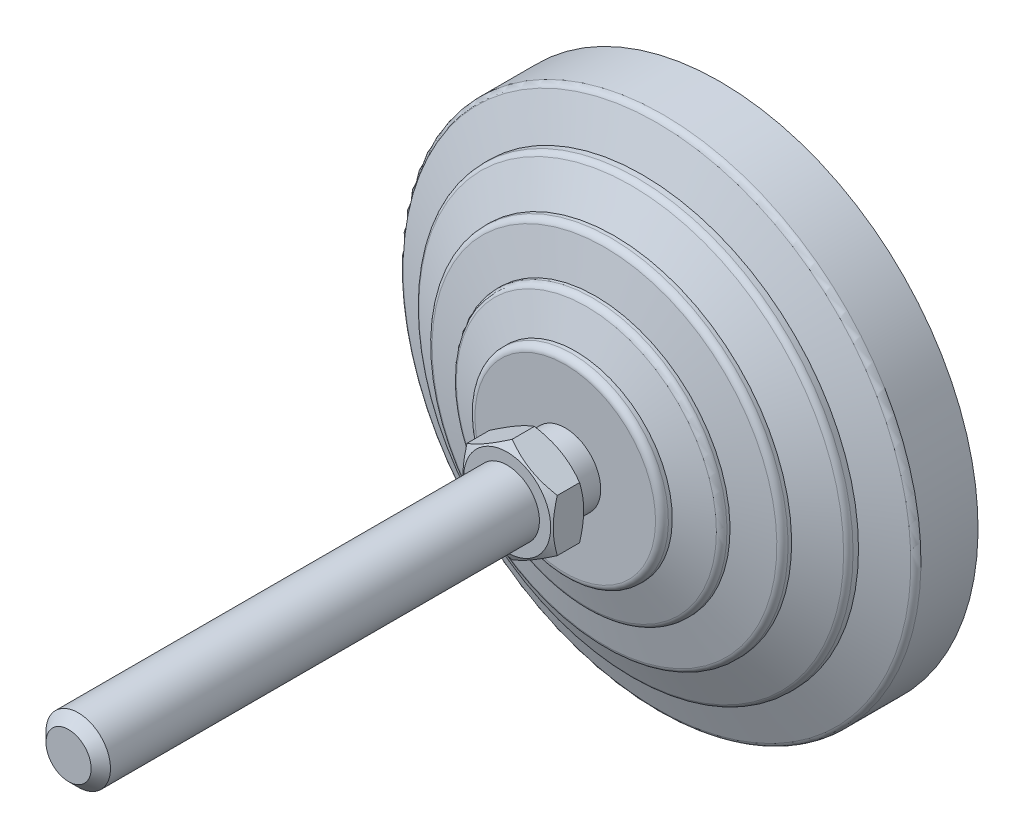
ISO-10303-21;
HEADER;
FILE_DESCRIPTION(('STEP AP214'),'2;1');
FILE_NAME('part.step','',(''),(''),'','','');
FILE_SCHEMA(('AUTOMOTIVE_DESIGN { 1 0 10303 214 1 1 1 1 }'));
ENDSEC;
DATA;
#1=APPLICATION_CONTEXT('core data for automotive mechanical design processes');
#2=APPLICATION_PROTOCOL_DEFINITION('international standard','automotive_design',2000,#1);
#3=PRODUCT_CONTEXT('',#1,'mechanical');
#4=PRODUCT('Part','Part','',(#3));
#5=PRODUCT_RELATED_PRODUCT_CATEGORY('part','',(#4));
#6=PRODUCT_DEFINITION_FORMATION('','',#4);
#7=PRODUCT_DEFINITION_CONTEXT('part definition',#1,'design');
#8=PRODUCT_DEFINITION('design','',#6,#7);
#9=PRODUCT_DEFINITION_SHAPE('','',#8);
#10=(LENGTH_UNIT() NAMED_UNIT(*) SI_UNIT(.MILLI.,.METRE.));
#11=(NAMED_UNIT(*) PLANE_ANGLE_UNIT() SI_UNIT($,.RADIAN.));
#12=(NAMED_UNIT(*) SI_UNIT($,.STERADIAN.) SOLID_ANGLE_UNIT());
#13=UNCERTAINTY_MEASURE_WITH_UNIT(LENGTH_MEASURE(1.E-05),#10,'distance_accuracy_value','');
#14=(GEOMETRIC_REPRESENTATION_CONTEXT(3) GLOBAL_UNCERTAINTY_ASSIGNED_CONTEXT((#13)) GLOBAL_UNIT_ASSIGNED_CONTEXT((#10,
#11,#12)) REPRESENTATION_CONTEXT('',''));
#15=CARTESIAN_POINT('',(0.,0.,0.));
#16=DIRECTION('',(0.,0.,1.));
#17=DIRECTION('',(1.,0.,0.));
#18=AXIS2_PLACEMENT_3D('',#15,#16,#17);
#19=CARTESIAN_POINT('',(-33.5,0.,3.00000000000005));
#20=DIRECTION('',(0.,0.,1.));
#21=DIRECTION('',(0.,-1.,0.));
#22=AXIS2_PLACEMENT_3D('',#19,#20,#21);
#23=PLANE('',#22);
#24=CARTESIAN_POINT('',(0.,0.,3.00000000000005));
#25=DIRECTION('',(0.,0.,-1.));
#26=DIRECTION('',(0.,1.,0.));
#27=AXIS2_PLACEMENT_3D('',#24,#25,#26);
#28=CIRCLE('',#27,33.5);
#29=CARTESIAN_POINT('',(0.,33.5,3.00000000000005));
#30=VERTEX_POINT('',#29);
#31=EDGE_CURVE('E27',#30,#30,#28,.T.);
#32=ORIENTED_EDGE('',*,*,#31,.F.);
#33=EDGE_LOOP('',(#32));
#34=FACE_BOUND('',#33,.T.);
#35=CARTESIAN_POINT('',(0.,0.,3.00000000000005));
#36=DIRECTION('',(0.,0.,-1.));
#37=DIRECTION('',(0.,1.,0.));
#38=AXIS2_PLACEMENT_3D('',#35,#36,#37);
#39=CIRCLE('',#38,40.);
#40=CARTESIAN_POINT('',(0.,40.,3.00000000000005));
#41=VERTEX_POINT('',#40);
#42=EDGE_CURVE('E95',#41,#41,#39,.T.);
#43=ORIENTED_EDGE('',*,*,#42,.T.);
#44=EDGE_LOOP('',(#43));
#45=FACE_BOUND('',#44,.T.);
#46=ADVANCED_FACE('F14',(#34,#45),#23,.F.);
#47=CARTESIAN_POINT('',(0.,0.,0.));
#48=DIRECTION('',(0.,0.,-1.));
#49=DIRECTION('',(0.,1.,0.));
#50=AXIS2_PLACEMENT_3D('',#47,#48,#49);
#51=CYLINDRICAL_SURFACE('',#50,33.5);
#52=CARTESIAN_POINT('',(0.,0.,0.));
#53=DIRECTION('',(0.,0.,-1.));
#54=DIRECTION('',(0.,1.,0.));
#55=AXIS2_PLACEMENT_3D('',#52,#53,#54);
#56=CIRCLE('',#55,33.5);
#57=CARTESIAN_POINT('',(0.,33.5,0.));
#58=VERTEX_POINT('',#57);
#59=EDGE_CURVE('E155',#58,#58,#56,.T.);
#60=ORIENTED_EDGE('',*,*,#59,.F.);
#61=EDGE_LOOP('',(#60));
#62=FACE_BOUND('',#61,.T.);
#63=ORIENTED_EDGE('',*,*,#31,.T.);
#64=EDGE_LOOP('',(#63));
#65=FACE_BOUND('',#64,.T.);
#66=ADVANCED_FACE('F160',(#62,#65),#51,.T.);
#67=CARTESIAN_POINT('',(0.,0.,0.));
#68=DIRECTION('',(0.,0.,1.));
#69=DIRECTION('',(0.,-1.,0.));
#70=AXIS2_PLACEMENT_3D('',#67,#68,#69);
#71=PLANE('',#70);
#72=ORIENTED_EDGE('',*,*,#59,.T.);
#73=EDGE_LOOP('',(#72));
#74=FACE_BOUND('',#73,.T.);
#75=ADVANCED_FACE('F264',(#74),#71,.F.);
#76=CARTESIAN_POINT('',(-5.50000000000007,0.,31.));
#77=DIRECTION('',(0.,0.,1.));
#78=DIRECTION('',(0.,-1.,0.));
#79=AXIS2_PLACEMENT_3D('',#76,#77,#78);
#80=PLANE('',#79);
#81=CARTESIAN_POINT('',(0.,0.,31.));
#82=DIRECTION('',(0.,0.,-1.));
#83=DIRECTION('',(-1.,0.,0.));
#84=AXIS2_PLACEMENT_3D('',#81,#82,#83);
#85=CIRCLE('',#84,6.75);
#86=CARTESIAN_POINT('',(-6.75,0.,31.));
#87=VERTEX_POINT('',#86);
#88=EDGE_CURVE('E599',#87,#87,#85,.T.);
#89=ORIENTED_EDGE('',*,*,#88,.T.);
#90=EDGE_LOOP('',(#89));
#91=FACE_BOUND('',#90,.T.);
#92=CARTESIAN_POINT('',(0.,0.,31.));
#93=DIRECTION('',(0.,0.,-1.));
#94=DIRECTION('',(0.,1.,0.));
#95=AXIS2_PLACEMENT_3D('',#92,#93,#94);
#96=CIRCLE('',#95,5.50000000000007);
#97=CARTESIAN_POINT('',(0.,5.50000000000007,31.));
#98=VERTEX_POINT('',#97);
#99=EDGE_CURVE('E143',#98,#98,#96,.T.);
#100=ORIENTED_EDGE('',*,*,#99,.F.);
#101=EDGE_LOOP('',(#100));
#102=FACE_BOUND('',#101,.T.);
#103=ADVANCED_FACE('F259',(#91,#102),#80,.F.);
#104=CARTESIAN_POINT('',(0.,0.,0.));
#105=DIRECTION('',(0.,0.,-1.));
#106=DIRECTION('',(0.,1.,0.));
#107=AXIS2_PLACEMENT_3D('',#104,#105,#106);
#108=CYLINDRICAL_SURFACE('',#107,5.50000000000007);
#109=CARTESIAN_POINT('',(0.,0.,27.));
#110=DIRECTION('',(0.,0.,-1.));
#111=DIRECTION('',(0.,1.,0.));
#112=AXIS2_PLACEMENT_3D('',#109,#110,#111);
#113=CIRCLE('',#112,5.50000000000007);
#114=CARTESIAN_POINT('',(0.,5.50000000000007,27.));
#115=VERTEX_POINT('',#114);
#116=EDGE_CURVE('E140',#115,#115,#113,.T.);
#117=ORIENTED_EDGE('',*,*,#116,.F.);
#118=EDGE_LOOP('',(#117));
#119=FACE_BOUND('',#118,.T.);
#120=ORIENTED_EDGE('',*,*,#99,.T.);
#121=EDGE_LOOP('',(#120));
#122=FACE_BOUND('',#121,.T.);
#123=ADVANCED_FACE('F253',(#119,#122),#108,.T.);
#124=CARTESIAN_POINT('',(-5.50000000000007,0.,27.));
#125=DIRECTION('',(0.,0.,-1.));
#126=DIRECTION('',(0.,1.,0.));
#127=AXIS2_PLACEMENT_3D('',#124,#125,#126);
#128=PLANE('',#127);
#129=CARTESIAN_POINT('',(0.,0.,27.));
#130=DIRECTION('',(0.,0.,-1.));
#131=DIRECTION('',(0.,1.,0.));
#132=AXIS2_PLACEMENT_3D('',#129,#130,#131);
#133=CIRCLE('',#132,14.);
#134=CARTESIAN_POINT('',(0.,14.,27.));
#135=VERTEX_POINT('',#134);
#136=EDGE_CURVE('E137',#135,#135,#133,.T.);
#137=ORIENTED_EDGE('',*,*,#136,.F.);
#138=EDGE_LOOP('',(#137));
#139=FACE_BOUND('',#138,.T.);
#140=ORIENTED_EDGE('',*,*,#116,.T.);
#141=EDGE_LOOP('',(#140));
#142=FACE_BOUND('',#141,.T.);
#143=ADVANCED_FACE('F247',(#139,#142),#128,.F.);
#144=CARTESIAN_POINT('',(0.,0.,26.));
#145=DIRECTION('',(0.,0.,-1.));
#146=DIRECTION('',(0.,1.,0.));
#147=AXIS2_PLACEMENT_3D('',#144,#145,#146);
#148=TOROIDAL_SURFACE('',#147,14.,1.);
#149=CARTESIAN_POINT('',(0.,0.,26.));
#150=DIRECTION('',(0.,0.,-1.));
#151=DIRECTION('',(0.,1.,0.));
#152=AXIS2_PLACEMENT_3D('',#149,#150,#151);
#153=CIRCLE('',#152,15.);
#154=CARTESIAN_POINT('',(0.,15.,26.));
#155=VERTEX_POINT('',#154);
#156=EDGE_CURVE('E134',#155,#155,#153,.T.);
#157=ORIENTED_EDGE('',*,*,#156,.F.);
#158=EDGE_LOOP('',(#157));
#159=FACE_BOUND('',#158,.T.);
#160=ORIENTED_EDGE('',*,*,#136,.T.);
#161=EDGE_LOOP('',(#160));
#162=FACE_BOUND('',#161,.T.);
#163=ADVANCED_FACE('F241',(#159,#162),#148,.T.);
#164=CARTESIAN_POINT('',(0.,0.,0.));
#165=DIRECTION('',(0.,0.,-1.));
#166=DIRECTION('',(0.,1.,0.));
#167=AXIS2_PLACEMENT_3D('',#164,#165,#166);
#168=CYLINDRICAL_SURFACE('',#167,15.);
#169=CARTESIAN_POINT('',(0.,0.,25.4025287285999));
#170=DIRECTION('',(0.,0.,-1.));
#171=DIRECTION('',(0.,1.,0.));
#172=AXIS2_PLACEMENT_3D('',#169,#170,#171);
#173=CIRCLE('',#172,15.);
#174=CARTESIAN_POINT('',(0.,15.,25.4025287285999));
#175=VERTEX_POINT('',#174);
#176=EDGE_CURVE('E131',#175,#175,#173,.T.);
#177=ORIENTED_EDGE('',*,*,#176,.F.);
#178=EDGE_LOOP('',(#177));
#179=FACE_BOUND('',#178,.T.);
#180=ORIENTED_EDGE('',*,*,#156,.T.);
#181=EDGE_LOOP('',(#180));
#182=FACE_BOUND('',#181,.T.);
#183=ADVANCED_FACE('F235',(#179,#182),#168,.T.);
#184=CARTESIAN_POINT('',(0.,0.,25.4025287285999));
#185=DIRECTION('',(0.,0.,-1.));
#186=DIRECTION('',(0.,1.,0.));
#187=AXIS2_PLACEMENT_3D('',#184,#185,#186);
#188=CONICAL_SURFACE('',#187,15.,1.25589726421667);
#189=CARTESIAN_POINT('',(0.,0.,23.7216684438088));
#190=DIRECTION('',(0.,0.,-1.));
#191=DIRECTION('',(0.,1.,0.));
#192=AXIS2_PLACEMENT_3D('',#189,#190,#191);
#193=CIRCLE('',#192,20.16016354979);
#194=CARTESIAN_POINT('',(0.,20.16016354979,23.7216684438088));
#195=VERTEX_POINT('',#194);
#196=EDGE_CURVE('E128',#195,#195,#193,.T.);
#197=ORIENTED_EDGE('',*,*,#196,.F.);
#198=EDGE_LOOP('',(#197));
#199=FACE_BOUND('',#198,.T.);
#200=ORIENTED_EDGE('',*,*,#176,.T.);
#201=EDGE_LOOP('',(#200));
#202=FACE_BOUND('',#201,.T.);
#203=ADVANCED_FACE('F229',(#199,#202),#188,.T.);
#204=CARTESIAN_POINT('',(0.,0.,22.7708407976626));
#205=DIRECTION('',(0.,0.,-1.));
#206=DIRECTION('',(0.,1.,0.));
#207=AXIS2_PLACEMENT_3D('',#204,#205,#206);
#208=TOROIDAL_SURFACE('',#207,19.8504430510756,0.999999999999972);
#209=CARTESIAN_POINT('',(0.,0.,22.7708407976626));
#210=DIRECTION('',(0.,0.,-1.));
#211=DIRECTION('',(0.,1.,0.));
#212=AXIS2_PLACEMENT_3D('',#209,#210,#211);
#213=CIRCLE('',#212,20.8504430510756);
#214=CARTESIAN_POINT('',(0.,20.8504430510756,22.7708407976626));
#215=VERTEX_POINT('',#214);
#216=EDGE_CURVE('E125',#215,#215,#213,.T.);
#217=ORIENTED_EDGE('',*,*,#216,.F.);
#218=EDGE_LOOP('',(#217));
#219=FACE_BOUND('',#218,.T.);
#220=ORIENTED_EDGE('',*,*,#196,.T.);
#221=EDGE_LOOP('',(#220));
#222=FACE_BOUND('',#221,.T.);
#223=ADVANCED_FACE('F223',(#219,#222),#208,.T.);
#224=CARTESIAN_POINT('',(0.,0.,0.));
#225=DIRECTION('',(0.,0.,-1.));
#226=DIRECTION('',(0.,1.,0.));
#227=AXIS2_PLACEMENT_3D('',#224,#225,#226);
#228=CYLINDRICAL_SURFACE('',#227,20.8504430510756);
#229=CARTESIAN_POINT('',(0.,0.,22.2987385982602));
#230=DIRECTION('',(0.,0.,-1.));
#231=DIRECTION('',(0.,1.,0.));
#232=AXIS2_PLACEMENT_3D('',#229,#230,#231);
#233=CIRCLE('',#232,20.8504430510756);
#234=CARTESIAN_POINT('',(0.,20.8504430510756,22.2987385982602));
#235=VERTEX_POINT('',#234);
#236=EDGE_CURVE('E122',#235,#235,#233,.T.);
#237=ORIENTED_EDGE('',*,*,#236,.F.);
#238=EDGE_LOOP('',(#237));
#239=FACE_BOUND('',#238,.T.);
#240=ORIENTED_EDGE('',*,*,#216,.T.);
#241=EDGE_LOOP('',(#240));
#242=FACE_BOUND('',#241,.T.);
#243=ADVANCED_FACE('F217',(#239,#242),#228,.T.);
#244=CARTESIAN_POINT('',(0.,0.,22.2987385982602));
#245=DIRECTION('',(0.,0.,-1.));
#246=DIRECTION('',(0.,1.,0.));
#247=AXIS2_PLACEMENT_3D('',#244,#245,#246);
#248=CONICAL_SURFACE('',#247,20.8504430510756,1.34067144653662);
#249=CARTESIAN_POINT('',(0.,0.,20.9217501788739));
#250=DIRECTION('',(0.,0.,-1.));
#251=DIRECTION('',(0.,1.,0.));
#252=AXIS2_PLACEMENT_3D('',#249,#250,#251);
#253=CIRCLE('',#252,26.728099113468);
#254=CARTESIAN_POINT('',(0.,26.728099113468,20.9217501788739));
#255=VERTEX_POINT('',#254);
#256=EDGE_CURVE('E119',#255,#255,#253,.T.);
#257=ORIENTED_EDGE('',*,*,#256,.F.);
#258=EDGE_LOOP('',(#257));
#259=FACE_BOUND('',#258,.T.);
#260=ORIENTED_EDGE('',*,*,#236,.T.);
#261=EDGE_LOOP('',(#260));
#262=FACE_BOUND('',#261,.T.);
#263=ADVANCED_FACE('F211',(#259,#262),#248,.T.);
#264=CARTESIAN_POINT('',(0.,0.,19.9481122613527));
#265=DIRECTION('',(0.,0.,-1.));
#266=DIRECTION('',(0.,1.,0.));
#267=AXIS2_PLACEMENT_3D('',#264,#265,#266);
#268=TOROIDAL_SURFACE('',#267,26.5,1.00000000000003);
#269=CARTESIAN_POINT('',(0.,0.,19.9481122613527));
#270=DIRECTION('',(0.,0.,-1.));
#271=DIRECTION('',(0.,1.,0.));
#272=AXIS2_PLACEMENT_3D('',#269,#270,#271);
#273=CIRCLE('',#272,27.5);
#274=CARTESIAN_POINT('',(0.,27.5,19.9481122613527));
#275=VERTEX_POINT('',#274);
#276=EDGE_CURVE('E116',#275,#275,#273,.T.);
#277=ORIENTED_EDGE('',*,*,#276,.F.);
#278=EDGE_LOOP('',(#277));
#279=FACE_BOUND('',#278,.T.);
#280=ORIENTED_EDGE('',*,*,#256,.T.);
#281=EDGE_LOOP('',(#280));
#282=FACE_BOUND('',#281,.T.);
#283=ADVANCED_FACE('F205',(#279,#282),#268,.T.);
#284=CARTESIAN_POINT('',(0.,0.,0.));
#285=DIRECTION('',(0.,0.,-1.));
#286=DIRECTION('',(0.,1.,0.));
#287=AXIS2_PLACEMENT_3D('',#284,#285,#286);
#288=CYLINDRICAL_SURFACE('',#287,27.5);
#289=CARTESIAN_POINT('',(0.,0.,19.4025287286));
#290=DIRECTION('',(0.,0.,-1.));
#291=DIRECTION('',(0.,1.,0.));
#292=AXIS2_PLACEMENT_3D('',#289,#290,#291);
#293=CIRCLE('',#292,27.5);
#294=CARTESIAN_POINT('',(0.,27.5,19.4025287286));
#295=VERTEX_POINT('',#294);
#296=EDGE_CURVE('E113',#295,#295,#293,.T.);
#297=ORIENTED_EDGE('',*,*,#296,.F.);
#298=EDGE_LOOP('',(#297));
#299=FACE_BOUND('',#298,.T.);
#300=ORIENTED_EDGE('',*,*,#276,.T.);
#301=EDGE_LOOP('',(#300));
#302=FACE_BOUND('',#301,.T.);
#303=ADVANCED_FACE('F199',(#299,#302),#288,.T.);
#304=CARTESIAN_POINT('',(0.,0.,19.4025287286));
#305=DIRECTION('',(0.,0.,-1.));
#306=DIRECTION('',(0.,1.,0.));
#307=AXIS2_PLACEMENT_3D('',#304,#305,#306);
#308=CONICAL_SURFACE('',#307,27.5,1.12022914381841);
#309=CARTESIAN_POINT('',(0.,0.,16.7730910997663));
#310=DIRECTION('',(0.,0.,-1.));
#311=DIRECTION('',(0.,1.,0.));
#312=AXIS2_PLACEMENT_3D('',#309,#310,#311);
#313=CIRCLE('',#312,32.9354761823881);
#314=CARTESIAN_POINT('',(0.,32.9354761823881,16.7730910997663));
#315=VERTEX_POINT('',#314);
#316=EDGE_CURVE('E110',#315,#315,#313,.T.);
#317=ORIENTED_EDGE('',*,*,#316,.F.);
#318=EDGE_LOOP('',(#317));
#319=FACE_BOUND('',#318,.T.);
#320=ORIENTED_EDGE('',*,*,#296,.T.);
#321=EDGE_LOOP('',(#320));
#322=FACE_BOUND('',#321,.T.);
#323=ADVANCED_FACE('F193',(#319,#322),#308,.T.);
#324=CARTESIAN_POINT('',(0.,0.,15.8728908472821));
#325=DIRECTION('',(0.,0.,-1.));
#326=DIRECTION('',(0.,1.,0.));
#327=AXIS2_PLACEMENT_3D('',#324,#325,#326);
#328=TOROIDAL_SURFACE('',#327,32.5,0.999999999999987);
#329=CARTESIAN_POINT('',(0.,0.,15.8728908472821));
#330=DIRECTION('',(0.,0.,-1.));
#331=DIRECTION('',(0.,1.,0.));
#332=AXIS2_PLACEMENT_3D('',#329,#330,#331);
#333=CIRCLE('',#332,33.5);
#334=CARTESIAN_POINT('',(0.,33.5,15.8728908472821));
#335=VERTEX_POINT('',#334);
#336=EDGE_CURVE('E107',#335,#335,#333,.T.);
#337=ORIENTED_EDGE('',*,*,#336,.F.);
#338=EDGE_LOOP('',(#337));
#339=FACE_BOUND('',#338,.T.);
#340=ORIENTED_EDGE('',*,*,#316,.T.);
#341=EDGE_LOOP('',(#340));
#342=FACE_BOUND('',#341,.T.);
#343=ADVANCED_FACE('F187',(#339,#342),#328,.T.);
#344=CARTESIAN_POINT('',(0.,0.,0.));
#345=DIRECTION('',(0.,0.,-1.));
#346=DIRECTION('',(0.,1.,0.));
#347=AXIS2_PLACEMENT_3D('',#344,#345,#346);
#348=CYLINDRICAL_SURFACE('',#347,33.5);
#349=CARTESIAN_POINT('',(0.,0.,15.0315037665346));
#350=DIRECTION('',(0.,0.,-1.));
#351=DIRECTION('',(0.,1.,0.));
#352=AXIS2_PLACEMENT_3D('',#349,#350,#351);
#353=CIRCLE('',#352,33.5);
#354=CARTESIAN_POINT('',(0.,33.5,15.0315037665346));
#355=VERTEX_POINT('',#354);
#356=EDGE_CURVE('E104',#355,#355,#353,.T.);
#357=ORIENTED_EDGE('',*,*,#356,.F.);
#358=EDGE_LOOP('',(#357));
#359=FACE_BOUND('',#358,.T.);
#360=ORIENTED_EDGE('',*,*,#336,.T.);
#361=EDGE_LOOP('',(#360));
#362=FACE_BOUND('',#361,.T.);
#363=ADVANCED_FACE('F181',(#359,#362),#348,.T.);
#364=CARTESIAN_POINT('',(0.,0.,15.0315037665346));
#365=DIRECTION('',(0.,0.,-1.));
#366=DIRECTION('',(0.,1.,0.));
#367=AXIS2_PLACEMENT_3D('',#364,#365,#366);
#368=CONICAL_SURFACE('',#367,33.5,1.20362249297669);
#369=CARTESIAN_POINT('',(0.,0.,12.7780502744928));
#370=DIRECTION('',(0.,0.,-1.));
#371=DIRECTION('',(0.,1.,0.));
#372=AXIS2_PLACEMENT_3D('',#369,#370,#371);
#373=CIRCLE('',#372,39.3589790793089);
#374=CARTESIAN_POINT('',(0.,39.3589790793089,12.7780502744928));
#375=VERTEX_POINT('',#374);
#376=EDGE_CURVE('E101',#375,#375,#373,.T.);
#377=ORIENTED_EDGE('',*,*,#376,.F.);
#378=EDGE_LOOP('',(#377));
#379=FACE_BOUND('',#378,.T.);
#380=ORIENTED_EDGE('',*,*,#356,.T.);
#381=EDGE_LOOP('',(#380));
#382=FACE_BOUND('',#381,.T.);
#383=ADVANCED_FACE('F175',(#379,#382),#368,.T.);
#384=CARTESIAN_POINT('',(0.,0.,11.8447046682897));
#385=DIRECTION('',(0.,0.,-1.));
#386=DIRECTION('',(0.,1.,0.));
#387=AXIS2_PLACEMENT_3D('',#384,#385,#386);
#388=TOROIDAL_SURFACE('',#387,39.,1.);
#389=CARTESIAN_POINT('',(0.,0.,11.8447046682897));
#390=DIRECTION('',(0.,0.,-1.));
#391=DIRECTION('',(0.,1.,0.));
#392=AXIS2_PLACEMENT_3D('',#389,#390,#391);
#393=CIRCLE('',#392,40.);
#394=CARTESIAN_POINT('',(0.,40.,11.8447046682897));
#395=VERTEX_POINT('',#394);
#396=EDGE_CURVE('E98',#395,#395,#393,.T.);
#397=ORIENTED_EDGE('',*,*,#396,.F.);
#398=EDGE_LOOP('',(#397));
#399=FACE_BOUND('',#398,.T.);
#400=ORIENTED_EDGE('',*,*,#376,.T.);
#401=EDGE_LOOP('',(#400));
#402=FACE_BOUND('',#401,.T.);
#403=ADVANCED_FACE('F169',(#399,#402),#388,.T.);
#404=CARTESIAN_POINT('',(0.,0.,0.));
#405=DIRECTION('',(0.,0.,-1.));
#406=DIRECTION('',(0.,1.,0.));
#407=AXIS2_PLACEMENT_3D('',#404,#405,#406);
#408=CYLINDRICAL_SURFACE('',#407,40.);
#409=ORIENTED_EDGE('',*,*,#42,.F.);
#410=EDGE_LOOP('',(#409));
#411=FACE_BOUND('',#410,.T.);
#412=ORIENTED_EDGE('',*,*,#396,.T.);
#413=EDGE_LOOP('',(#412));
#414=FACE_BOUND('',#413,.T.);
#415=ADVANCED_FACE('F166',(#411,#414),#408,.T.);
#416=CARTESIAN_POINT('',(0.,0.,32.4818305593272));
#417=DIRECTION('',(0.,0.,1.));
#418=DIRECTION('',(1.,0.,0.));
#419=AXIS2_PLACEMENT_3D('',#416,#417,#418);
#420=CONICAL_SURFACE('',#419,9.31660581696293,1.0471975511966);
#421=CARTESIAN_POINT('',(0.256809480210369,-8.23117279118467,31.8574679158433));
#422=CARTESIAN_POINT('',(-0.0698264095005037,-8.0425894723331,31.7427482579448));
#423=CARTESIAN_POINT('',(-0.399517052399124,-7.85224249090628,31.6377529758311));
#424=CARTESIAN_POINT('',(-1.06527703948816,-7.46786578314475,31.4534247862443));
#425=CARTESIAN_POINT('',(-1.40136324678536,-7.27382632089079,31.3741740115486));
#426=CARTESIAN_POINT('',(-1.9040737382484,-6.98358628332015,31.2807121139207));
#427=CARTESIAN_POINT('',(-2.06895049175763,-6.88839464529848,31.2540137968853));
#428=CARTESIAN_POINT('',(-2.39956695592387,-6.69751314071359,31.2089673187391));
#429=CARTESIAN_POINT('',(-2.56530667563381,-6.60182326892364,31.1906192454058));
#430=CARTESIAN_POINT('',(-2.89707927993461,-6.41027426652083,31.1627968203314));
#431=CARTESIAN_POINT('',(-3.06311125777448,-6.3144156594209,31.1533081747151));
#432=CARTESIAN_POINT('',(-3.39537917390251,-6.1225806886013,31.1434247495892));
#433=CARTESIAN_POINT('',(-3.56161511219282,-6.0266043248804,31.1430299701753));
#434=CARTESIAN_POINT('',(-3.9043017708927,-5.82875409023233,31.1516081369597));
#435=CARTESIAN_POINT('',(-4.08074157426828,-5.72688652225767,31.1611680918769));
#436=CARTESIAN_POINT('',(-4.43300193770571,-5.52350890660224,31.19026113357));
#437=CARTESIAN_POINT('',(-4.60882247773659,-5.42199887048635,31.209794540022));
#438=CARTESIAN_POINT('',(-4.95981304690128,-5.21935437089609,31.2582845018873));
#439=CARTESIAN_POINT('',(-5.13498123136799,-5.11822097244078,31.2872587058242));
#440=CARTESIAN_POINT('',(-5.48408773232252,-4.91666424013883,31.3538262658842));
#441=CARTESIAN_POINT('',(-5.65802595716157,-4.81624095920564,31.391420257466));
#442=CARTESIAN_POINT('',(-6.01003966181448,-4.61300575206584,31.4756522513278));
#443=CARTESIAN_POINT('',(-6.18806989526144,-4.51021994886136,31.5225407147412));
#444=CARTESIAN_POINT('',(-6.5425973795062,-4.30553341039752,31.6235400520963));
#445=CARTESIAN_POINT('',(-6.71909446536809,-4.20363277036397,31.6776516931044));
#446=CARTESIAN_POINT('',(-7.06982221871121,-4.00114000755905,31.791893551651));
#447=CARTESIAN_POINT('',(-7.24405924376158,-3.90054421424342,31.8519979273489));
#448=CARTESIAN_POINT('',(-7.5910148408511,-3.70022930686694,31.9775492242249));
#449=CARTESIAN_POINT('',(-7.76373396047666,-3.60050987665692,32.0429941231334));
#450=CARTESIAN_POINT('',(-7.93576366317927,-3.50118848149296,32.1107017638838));
#451=B_SPLINE_CURVE_WITH_KNOTS('',3,(#421,#422,#423,#424,#425,#426,#427,#428,#429,#430,#431,
#432,#433,#434,#435,#436,#437,#438,#439,#440,#441,#442,#443,#444,#445,#446,#447,#448,#449,#450),
.UNSPECIFIED.,.F.,.F.,(4,2,2,2,2,2,2,2,2,2,2,2,2,2,4),(0.,1.18342690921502,2.37059305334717,
2.94716269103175,3.52373838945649,4.09938222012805,4.67502605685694,5.28664664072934,
5.89828682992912,6.51107703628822,7.12391243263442,7.75631694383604,8.38878866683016,
9.01864220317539,9.64825833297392),.UNSPECIFIED.);
#452=CARTESIAN_POINT('',(0.,-8.08290376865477,31.7695523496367));
#453=VERTEX_POINT('',#452);
#454=CARTESIAN_POINT('',(-7.,-4.04145188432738,31.7695523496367));
#455=VERTEX_POINT('',#454);
#456=EDGE_CURVE('E72',#453,#455,#451,.T.);
#457=ORIENTED_EDGE('',*,*,#456,.T.);
#458=CARTESIAN_POINT('',(-7.,-10.7975012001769,34.5322425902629));
#459=CARTESIAN_POINT('',(-7.,-10.4922479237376,34.3844029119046));
#460=CARTESIAN_POINT('',(-7.,-10.1862876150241,34.2379977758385));
#461=CARTESIAN_POINT('',(-7.,-9.57257669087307,33.9488646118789));
#462=CARTESIAN_POINT('',(-7.,-9.26482579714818,33.8061371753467));
#463=CARTESIAN_POINT('',(-7.,-8.64554367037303,33.5244368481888));
#464=CARTESIAN_POINT('',(-7.,-8.3340009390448,33.385489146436));
#465=CARTESIAN_POINT('',(-7.,-7.70841708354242,33.1133585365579));
#466=CARTESIAN_POINT('',(-7.,-7.39437608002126,32.9801753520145));
#467=CARTESIAN_POINT('',(-7.,-6.75339028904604,32.7170311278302));
#468=CARTESIAN_POINT('',(-7.,-6.4263496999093,32.5873021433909));
#469=CARTESIAN_POINT('',(-7.,-5.76842168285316,32.337804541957));
#470=CARTESIAN_POINT('',(-7.,-5.43753382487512,32.2180370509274));
#471=CARTESIAN_POINT('',(-7.,-4.77201925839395,31.9916497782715));
#472=CARTESIAN_POINT('',(-7.,-4.43740187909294,31.8850028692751));
#473=CARTESIAN_POINT('',(-7.,-3.76338005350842,31.6883157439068));
#474=CARTESIAN_POINT('',(-7.,-3.42397717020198,31.5982702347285));
#475=CARTESIAN_POINT('',(-7.,-2.74200549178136,31.4396268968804));
#476=CARTESIAN_POINT('',(-7.,-2.39946395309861,31.3709150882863));
#477=CARTESIAN_POINT('',(-7.,-1.88257958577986,31.2868517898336));
#478=CARTESIAN_POINT('',(-7.,-1.70975964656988,31.2619969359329));
#479=CARTESIAN_POINT('',(-7.,-1.36328075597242,31.2191108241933));
#480=CARTESIAN_POINT('',(-7.,-1.189621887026,31.2010789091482));
#481=CARTESIAN_POINT('',(-7.,-0.843940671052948,31.1724210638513));
#482=CARTESIAN_POINT('',(-7.,-0.671926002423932,31.1617028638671));
#483=CARTESIAN_POINT('',(-7.,-0.327597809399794,31.1475461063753));
#484=CARTESIAN_POINT('',(-7.,-0.155284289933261,31.1441074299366));
#485=CARTESIAN_POINT('',(-7.,0.189334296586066,31.1445916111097));
#486=CARTESIAN_POINT('',(-7.,0.361639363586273,31.1485145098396));
#487=CARTESIAN_POINT('',(-7.,0.705932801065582,31.1636269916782));
#488=CARTESIAN_POINT('',(-7.,0.87792115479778,31.1748169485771));
#489=CARTESIAN_POINT('',(-7.,1.29304638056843,31.2103615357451));
#490=CARTESIAN_POINT('',(-7.,1.53588576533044,31.2382631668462));
#491=CARTESIAN_POINT('',(-7.,2.01971219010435,31.3070181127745));
#492=CARTESIAN_POINT('',(-7.,2.2606989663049,31.3478732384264));
#493=CARTESIAN_POINT('',(-7.,2.98063294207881,31.4876981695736));
#494=CARTESIAN_POINT('',(-7.,3.45627473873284,31.6039005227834));
#495=CARTESIAN_POINT('',(-7.,4.16741110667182,31.8047752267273));
#496=CARTESIAN_POINT('',(-7.,4.40661000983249,31.8770823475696));
#497=CARTESIAN_POINT('',(-7.,4.88268350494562,32.0290493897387));
#498=CARTESIAN_POINT('',(-7.,5.11955808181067,32.1087093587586));
#499=CARTESIAN_POINT('',(-7.,5.59106050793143,32.2741170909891));
#500=CARTESIAN_POINT('',(-7.,5.82568910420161,32.3598627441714));
#501=CARTESIAN_POINT('',(-7.,6.29301296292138,32.5364486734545));
#502=CARTESIAN_POINT('',(-7.,6.52570824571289,32.6272888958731));
#503=CARTESIAN_POINT('',(-7.,7.06527662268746,32.8436479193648));
#504=CARTESIAN_POINT('',(-7.,7.37149937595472,32.9707853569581));
#505=CARTESIAN_POINT('',(-7.,7.9814230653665,33.230988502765));
#506=CARTESIAN_POINT('',(-7.,8.28512386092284,33.364054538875));
#507=CARTESIAN_POINT('',(-7.,8.89045510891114,33.6349508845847));
#508=CARTESIAN_POINT('',(-7.,9.19208516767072,33.7727820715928));
#509=CARTESIAN_POINT('',(-7.,9.79356744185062,34.0522771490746));
#510=CARTESIAN_POINT('',(-7.,10.0934196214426,34.1939411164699));
#511=CARTESIAN_POINT('',(-7.,10.6919250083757,34.480538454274));
#512=CARTESIAN_POINT('',(-7.,10.9905767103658,34.6254749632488));
#513=CARTESIAN_POINT('',(-7.,11.5866119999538,34.917934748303));
#514=CARTESIAN_POINT('',(-7.,11.8839955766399,35.0654580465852));
#515=CARTESIAN_POINT('',(-7.,12.7744680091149,35.511197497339));
#516=CARTESIAN_POINT('',(-7.,13.3659523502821,35.8126188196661));
#517=CARTESIAN_POINT('',(-7.,14.4979166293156,36.3968065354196));
#518=CARTESIAN_POINT('',(-7.,15.0386406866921,36.6791019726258));
#519=CARTESIAN_POINT('',(-7.,16.1180723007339,37.2475615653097));
#520=CARTESIAN_POINT('',(-7.,16.6567797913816,37.5337258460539));
#521=CARTESIAN_POINT('',(-7.,17.7313476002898,38.1083333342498));
#522=CARTESIAN_POINT('',(-7.,18.2672116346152,38.3967696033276));
#523=CARTESIAN_POINT('',(-7.,19.3376447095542,38.9759697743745));
#524=CARTESIAN_POINT('',(-7.,19.8722138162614,39.2667335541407));
#525=CARTESIAN_POINT('',(-7.,20.4063035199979,39.5583693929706));
#526=B_SPLINE_CURVE_WITH_KNOTS('',3,(#458,#459,#460,#461,#462,#463,#464,#465,#466,#467,#468,
#469,#470,#471,#472,#473,#474,#475,#476,#477,#478,#479,#480,#481,#482,#483,#484,#485,#486,#487,
#488,#489,#490,#491,#492,#493,#494,#495,#496,#497,#498,#499,#500,#501,#502,#503,#504,#505,#506,
#507,#508,#509,#510,#511,#512,#513,#514,#515,#516,#517,#518,#519,#520,#521,#522,#523,#524,#525),
.UNSPECIFIED.,.F.,.F.,(4,2,2,2,2,2,2,2,2,2,2,2,2,2,2,2,2,2,2,2,2,2,2,2,2,2,2,2,2,2,2,2,2,4),(0.,
1.01752202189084,2.03520664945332,3.05853080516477,4.08180583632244,5.13717340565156,
6.19266010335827,7.24592649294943,8.29885650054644,9.34606014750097,9.86974091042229,
10.393371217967,10.9102668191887,11.4271539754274,11.944044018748,12.4609606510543,
13.1938564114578,13.9268546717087,15.3936884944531,16.1432945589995,16.8929054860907,
17.6422577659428,18.3916021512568,19.386218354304,20.3808896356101,21.375745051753,
22.3706204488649,23.3664943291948,24.3623767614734,26.3538958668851,28.1838132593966,
30.0137900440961,31.8394650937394,33.6650449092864),.UNSPECIFIED.);
#527=CARTESIAN_POINT('',(-7.,4.04145188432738,31.7695523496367));
#528=VERTEX_POINT('',#527);
#529=EDGE_CURVE('E80',#455,#528,#526,.T.);
#530=ORIENTED_EDGE('',*,*,#529,.T.);
#531=CARTESIAN_POINT('',(-12.6792262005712,0.762549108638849,34.4364673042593));
#532=CARTESIAN_POINT('',(-12.4107156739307,0.917573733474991,34.2871416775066));
#533=CARTESIAN_POINT('',(-12.1415512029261,1.07297591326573,34.1393538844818));
#534=CARTESIAN_POINT('',(-11.6015534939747,1.38474373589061,33.8477503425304));
#535=CARTESIAN_POINT('',(-11.3307199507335,1.54110955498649,33.7039353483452));
#536=CARTESIAN_POINT('',(-10.7854072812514,1.8559459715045,33.4203378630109));
#537=CARTESIAN_POINT('',(-10.5109159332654,2.01442362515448,33.2805865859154));
#538=CARTESIAN_POINT('',(-9.9595961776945,2.33272823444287,33.0073975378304));
#539=CARTESIAN_POINT('',(-9.68276790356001,2.49255511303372,32.8739594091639));
#540=CARTESIAN_POINT('',(-9.12376613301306,2.81529493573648,32.6139363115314));
#541=CARTESIAN_POINT('',(-8.84156692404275,2.97822272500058,32.4874246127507));
#542=CARTESIAN_POINT('',(-8.27373645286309,3.30605980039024,32.2449134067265));
#543=CARTESIAN_POINT('',(-7.98810478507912,3.47096932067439,32.1289151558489));
#544=CARTESIAN_POINT('',(-7.41361632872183,3.80265038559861,31.9107865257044));
#545=CARTESIAN_POINT('',(-7.12476898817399,3.96941647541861,31.8086233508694));
#546=CARTESIAN_POINT('',(-6.54293272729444,4.30533979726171,31.6217105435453));
#547=CARTESIAN_POINT('',(-6.24994527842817,4.47449617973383,31.5369548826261));
#548=CARTESIAN_POINT('',(-5.66404302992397,4.81276700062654,31.3903673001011));
#549=CARTESIAN_POINT('',(-5.37118910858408,4.98184629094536,31.3282200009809));
#550=CARTESIAN_POINT('',(-4.92950965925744,5.23685003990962,31.254090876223));
#551=CARTESIAN_POINT('',(-4.78186388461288,5.32209336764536,31.2325615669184));
#552=CARTESIAN_POINT('',(-4.48595271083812,5.49293776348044,31.1962936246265));
#553=CARTESIAN_POINT('',(-4.33768737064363,5.57853879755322,31.1815543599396));
#554=CARTESIAN_POINT('',(-4.04157742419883,5.74949795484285,31.1592542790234));
#555=CARTESIAN_POINT('',(-3.89373505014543,5.83485478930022,31.1516540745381));
#556=CARTESIAN_POINT('',(-3.59790513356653,6.00565227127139,31.1436636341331));
#557=CARTESIAN_POINT('',(-3.44991759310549,6.09109291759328,31.1432732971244));
#558=CARTESIAN_POINT('',(-3.15409742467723,6.26188477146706,31.1497116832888));
#559=CARTESIAN_POINT('',(-3.0062647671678,6.34723599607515,31.1565385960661));
#560=CARTESIAN_POINT('',(-2.71096838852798,6.51772543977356,31.1772499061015));
#561=CARTESIAN_POINT('',(-2.56350468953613,6.6028636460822,31.1911347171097));
#562=CARTESIAN_POINT('',(-2.19945908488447,6.81304547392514,31.2338458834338));
#563=CARTESIAN_POINT('',(-1.98321964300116,6.93789137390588,31.2666342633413));
#564=CARTESIAN_POINT('',(-1.55257453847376,7.18652444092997,31.345502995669));
#565=CARTESIAN_POINT('',(-1.33816918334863,7.31031143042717,31.3915855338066));
#566=CARTESIAN_POINT('',(-0.697259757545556,7.68034065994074,31.5474435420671));
#567=CARTESIAN_POINT('',(-0.273917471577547,7.92475744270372,31.6747167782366));
#568=CARTESIAN_POINT('',(0.358965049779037,8.29015233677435,31.8921329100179));
#569=CARTESIAN_POINT('',(0.5718512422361,8.41306223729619,31.9700105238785));
#570=CARTESIAN_POINT('',(0.995568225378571,8.65769535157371,32.1330259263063));
#571=CARTESIAN_POINT('',(1.20639883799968,8.77941846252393,32.2181643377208));
#572=CARTESIAN_POINT('',(1.62494686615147,9.02106727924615,32.3939161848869));
#573=CARTESIAN_POINT('',(1.83267522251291,9.14099930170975,32.4844952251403));
#574=CARTESIAN_POINT('',(2.24639748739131,9.37986196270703,32.6705704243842));
#575=CARTESIAN_POINT('',(2.45239194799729,9.49879291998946,32.76606494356));
#576=CARTESIAN_POINT('',(2.65766162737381,9.61730542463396,32.863549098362));
#577=B_SPLINE_CURVE_WITH_KNOTS('',3,(#531,#532,#533,#534,#535,#536,#537,#538,#539,#540,#541,
#542,#543,#544,#545,#546,#547,#548,#549,#550,#551,#552,#553,#554,#555,#556,#557,#558,#559,#560,
#561,#562,#563,#564,#565,#566,#567,#568,#569,#570,#571,#572,#573,#574,#575,#576),.UNSPECIFIED.,
.F.,.F.,(4,2,2,2,2,2,2,2,2,2,2,2,2,2,2,2,2,2,2,2,2,2,4),(0.,1.03241927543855,2.06503335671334,
3.1041707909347,4.14324928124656,5.19176730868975,6.24041047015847,7.2865226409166,
8.33227191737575,9.36281678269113,9.87822448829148,10.393584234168,10.9060835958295,
11.4185757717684,11.9309394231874,12.4433331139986,13.1984050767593,13.9536012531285,
15.4669620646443,16.2404919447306,17.0140882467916,17.7832244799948,18.5521057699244),.UNSPECIFIED.);
#578=CARTESIAN_POINT('',(0.,8.08290376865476,31.7695523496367));
#579=VERTEX_POINT('',#578);
#580=EDGE_CURVE('E554',#528,#579,#577,.T.);
#581=ORIENTED_EDGE('',*,*,#580,.T.);
#582=CARTESIAN_POINT('',(-0.942295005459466,8.62693804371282,32.1132742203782));
#583=CARTESIAN_POINT('',(-0.770172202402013,8.52756289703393,32.0454650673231));
#584=CARTESIAN_POINT('',(-0.597359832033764,8.42778962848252,31.9799170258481));
#585=CARTESIAN_POINT('',(-0.250216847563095,8.22736653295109,31.854156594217));
#586=CARTESIAN_POINT('',(-0.0758856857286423,8.12671638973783,31.793946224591));
#587=CARTESIAN_POINT('',(0.275033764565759,7.92411295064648,31.6794890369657));
#588=CARTESIAN_POINT('',(0.451628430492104,7.82215597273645,31.6252681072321));
#589=CARTESIAN_POINT('',(0.806353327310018,7.61735545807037,31.5240490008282));
#590=CARTESIAN_POINT('',(0.984483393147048,7.51451201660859,31.4770500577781));
#591=CARTESIAN_POINT('',(1.33669350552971,7.31116341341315,31.3926018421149));
#592=CARTESIAN_POINT('',(1.51072818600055,7.21068444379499,31.3549019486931));
#593=CARTESIAN_POINT('',(1.8600311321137,7.00901429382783,31.2881251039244));
#594=CARTESIAN_POINT('',(2.03529930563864,6.90782316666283,31.2590475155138));
#595=CARTESIAN_POINT('',(2.38649332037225,6.70506120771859,31.2103564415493));
#596=CARTESIAN_POINT('',(2.56241730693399,6.60349144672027,31.1907252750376));
#597=CARTESIAN_POINT('',(2.91488869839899,6.3999919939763,31.1614453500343));
#598=CARTESIAN_POINT('',(3.09143608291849,6.29806231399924,31.1517962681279));
#599=CARTESIAN_POINT('',(3.43415174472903,6.10019533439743,31.1430611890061));
#600=CARTESIAN_POINT('',(3.60030870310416,6.00426456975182,31.1433774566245));
#601=CARTESIAN_POINT('',(3.93242211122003,5.81251880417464,31.1530964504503));
#602=CARTESIAN_POINT('',(4.09837856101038,5.71670380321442,31.1624991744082));
#603=CARTESIAN_POINT('',(4.43000309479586,5.52524028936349,31.1901448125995));
#604=CARTESIAN_POINT('',(4.59567027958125,5.42959229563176,31.208401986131));
#605=CARTESIAN_POINT('',(4.92614505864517,5.23879259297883,31.2532643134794));
#606=CARTESIAN_POINT('',(5.09095266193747,5.14364087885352,31.2798693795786));
#607=CARTESIAN_POINT('',(5.59344833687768,4.85352486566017,31.3730447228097));
#608=CARTESIAN_POINT('',(5.92939366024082,4.65956674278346,31.4521015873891));
#609=CARTESIAN_POINT('',(6.5948826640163,4.27534648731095,31.6360525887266));
#610=CARTESIAN_POINT('',(6.92444313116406,4.08507466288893,31.740864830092));
#611=CARTESIAN_POINT('',(7.25094950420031,3.89656612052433,31.8554111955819));
#612=B_SPLINE_CURVE_WITH_KNOTS('',3,(#582,#583,#584,#585,#586,#587,#588,#589,#590,#591,#592,
#593,#594,#595,#596,#597,#598,#599,#600,#601,#602,#603,#604,#605,#606,#607,#608,#609,#610,#611),
.UNSPECIFIED.,.F.,.F.,(4,2,2,2,2,2,2,2,2,2,2,2,2,2,4),(0.,0.630019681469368,1.26027684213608,
1.89315956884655,2.52597508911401,3.13919744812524,3.75237448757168,4.3643993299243,
4.97640434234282,5.55177449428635,6.12714450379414,6.70344418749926,7.27973781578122,
8.46630862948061,9.64915420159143),.UNSPECIFIED.);
#613=CARTESIAN_POINT('',(7.,4.04145188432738,31.7695523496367));
#614=VERTEX_POINT('',#613);
#615=EDGE_CURVE('E549',#579,#614,#612,.T.);
#616=ORIENTED_EDGE('',*,*,#615,.T.);
#617=CARTESIAN_POINT('',(7.,-10.7975012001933,34.5322425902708));
#618=CARTESIAN_POINT('',(7.,-10.4922479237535,34.3844029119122));
#619=CARTESIAN_POINT('',(7.,-10.1862876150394,34.2379977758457));
#620=CARTESIAN_POINT('',(7.,-9.57257669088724,33.9488646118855));
#621=CARTESIAN_POINT('',(7.,-9.26482579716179,33.806137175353));
#622=CARTESIAN_POINT('',(7.,-8.64554367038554,33.5244368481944));
#623=CARTESIAN_POINT('',(7.,-8.33400093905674,33.3854891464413));
#624=CARTESIAN_POINT('',(7.,-7.70841708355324,33.1133585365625));
#625=CARTESIAN_POINT('',(7.,-7.39437608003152,32.9801753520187));
#626=CARTESIAN_POINT('',(7.,-6.75339028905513,32.7170311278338));
#627=CARTESIAN_POINT('',(7.,-6.42634969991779,32.5873021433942));
#628=CARTESIAN_POINT('',(7.,-5.76842168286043,32.3378045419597));
#629=CARTESIAN_POINT('',(7.,-5.43753382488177,32.2180370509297));
#630=CARTESIAN_POINT('',(7.,-4.77201925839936,31.9916497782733));
#631=CARTESIAN_POINT('',(7.,-4.43740187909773,31.8850028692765));
#632=CARTESIAN_POINT('',(7.,-3.76338005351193,31.6883157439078));
#633=CARTESIAN_POINT('',(7.,-3.42397717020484,31.5982702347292));
#634=CARTESIAN_POINT('',(7.,-2.74200549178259,31.4396268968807));
#635=CARTESIAN_POINT('',(7.,-2.39946395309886,31.3709150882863));
#636=CARTESIAN_POINT('',(7.,-1.8825795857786,31.2868517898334));
#637=CARTESIAN_POINT('',(7.,-1.70975964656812,31.2619969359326));
#638=CARTESIAN_POINT('',(7.,-1.36328075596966,31.219110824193));
#639=CARTESIAN_POINT('',(7.,-1.18962188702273,31.2010789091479));
#640=CARTESIAN_POINT('',(7.,-0.843940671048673,31.172421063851));
#641=CARTESIAN_POINT('',(7.,-0.671926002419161,31.1617028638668));
#642=CARTESIAN_POINT('',(7.,-0.327597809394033,31.1475461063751));
#643=CARTESIAN_POINT('',(7.,-0.155284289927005,31.1441074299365));
#644=CARTESIAN_POINT('',(7.,0.189334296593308,31.1445916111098));
#645=CARTESIAN_POINT('',(7.,0.361639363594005,31.1485145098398));
#646=CARTESIAN_POINT('',(7.,0.70593280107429,31.1636269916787));
#647=CARTESIAN_POINT('',(7.,0.877921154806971,31.1748169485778));
#648=CARTESIAN_POINT('',(7.,1.29304638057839,31.2103615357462));
#649=CARTESIAN_POINT('',(7.,1.53588576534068,31.2382631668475));
#650=CARTESIAN_POINT('',(7.,2.01971219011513,31.3070181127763));
#651=CARTESIAN_POINT('',(7.,2.26069896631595,31.3478732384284));
#652=CARTESIAN_POINT('',(7.,2.98063294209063,31.4876981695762));
#653=CARTESIAN_POINT('',(7.,3.45627473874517,31.6039005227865));
#654=CARTESIAN_POINT('',(7.,4.16741110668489,31.8047752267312));
#655=CARTESIAN_POINT('',(7.,4.40661000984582,31.8770823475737));
#656=CARTESIAN_POINT('',(7.,4.88268350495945,32.0290493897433));
#657=CARTESIAN_POINT('',(7.,5.11955808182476,32.1087093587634));
#658=CARTESIAN_POINT('',(7.,5.59106050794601,32.2741170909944));
#659=CARTESIAN_POINT('',(7.,5.82568910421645,32.3598627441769));
#660=CARTESIAN_POINT('',(7.,6.29301296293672,32.5364486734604));
#661=CARTESIAN_POINT('',(7.,6.52570824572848,32.6272888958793));
#662=CARTESIAN_POINT('',(7.,7.06527662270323,32.8436479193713));
#663=CARTESIAN_POINT('',(7.,7.37149937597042,32.9707853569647));
#664=CARTESIAN_POINT('',(7.,7.98142306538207,33.2309885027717));
#665=CARTESIAN_POINT('',(7.,8.28512386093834,33.3640545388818));
#666=CARTESIAN_POINT('',(7.,8.89045510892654,33.6349508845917));
#667=CARTESIAN_POINT('',(7.,9.19208516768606,33.7727820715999));
#668=CARTESIAN_POINT('',(7.,9.79356744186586,34.0522771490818));
#669=CARTESIAN_POINT('',(7.,10.0934196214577,34.1939411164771));
#670=CARTESIAN_POINT('',(7.,10.6919250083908,34.4805384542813));
#671=CARTESIAN_POINT('',(7.,10.9905767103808,34.6254749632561));
#672=CARTESIAN_POINT('',(7.,11.5866119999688,34.9179347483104));
#673=CARTESIAN_POINT('',(7.,11.8839955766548,35.0654580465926));
#674=CARTESIAN_POINT('',(7.,12.7744680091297,35.5111974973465));
#675=CARTESIAN_POINT('',(7.,13.3659523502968,35.8126188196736));
#676=CARTESIAN_POINT('',(7.,14.4979166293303,36.3968065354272));
#677=CARTESIAN_POINT('',(7.,15.0386406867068,36.6791019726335));
#678=CARTESIAN_POINT('',(7.,16.1180723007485,37.2475615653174));
#679=CARTESIAN_POINT('',(7.,16.6567797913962,37.5337258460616));
#680=CARTESIAN_POINT('',(7.,17.7313476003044,38.1083333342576));
#681=CARTESIAN_POINT('',(7.,18.2672116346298,38.3967696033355));
#682=CARTESIAN_POINT('',(7.,19.3376447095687,38.9759697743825));
#683=CARTESIAN_POINT('',(7.,19.8722138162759,39.2667335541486));
#684=CARTESIAN_POINT('',(7.,20.4063035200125,39.5583693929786));
#685=B_SPLINE_CURVE_WITH_KNOTS('',3,(#617,#618,#619,#620,#621,#622,#623,#624,#625,#626,#627,
#628,#629,#630,#631,#632,#633,#634,#635,#636,#637,#638,#639,#640,#641,#642,#643,#644,#645,#646,
#647,#648,#649,#650,#651,#652,#653,#654,#655,#656,#657,#658,#659,#660,#661,#662,#663,#664,#665,
#666,#667,#668,#669,#670,#671,#672,#673,#674,#675,#676,#677,#678,#679,#680,#681,#682,#683,#684),
.UNSPECIFIED.,.F.,.F.,(4,2,2,2,2,2,2,2,2,2,2,2,2,2,2,2,2,2,2,2,2,2,2,2,2,2,2,2,2,2,2,2,2,4),(0.,
1.01752202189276,2.03520664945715,3.05853080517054,4.08180583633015,5.13717340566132,
6.19266010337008,7.24592649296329,8.29885650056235,9.34606014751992,9.86974091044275,
10.3933712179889,10.9102668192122,11.4271539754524,11.9440440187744,12.4609606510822,
13.1938564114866,13.9268546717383,15.3936884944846,16.143294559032,16.8929054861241,
17.6422577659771,18.3916021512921,19.3862183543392,20.3808896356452,21.375745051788,
22.3706204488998,23.3664943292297,24.3623767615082,26.3538958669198,28.1838132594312,
30.0137900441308,31.8394650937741,33.6650449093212),.UNSPECIFIED.);
#686=CARTESIAN_POINT('',(7.,-4.04145188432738,31.7695523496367));
#687=VERTEX_POINT('',#686);
#688=EDGE_CURVE('E33',#614,#687,#685,.F.);
#689=ORIENTED_EDGE('',*,*,#688,.T.);
#690=CARTESIAN_POINT('',(-5.68386136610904,-11.3644826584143,34.4390460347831));
#691=CARTESIAN_POINT('',(-5.415380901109,-11.2094753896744,34.289714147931));
#692=CARTESIAN_POINT('',(-5.1462472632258,-11.0540910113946,34.1419180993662));
#693=CARTESIAN_POINT('',(-4.60631335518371,-10.7423600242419,33.8502924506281));
#694=CARTESIAN_POINT('',(-4.33551278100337,-10.5860132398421,33.7064636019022));
#695=CARTESIAN_POINT('',(-3.7902735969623,-10.2712192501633,33.422833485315));
#696=CARTESIAN_POINT('',(-3.51582281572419,-10.1127650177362,33.2830632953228));
#697=CARTESIAN_POINT('',(-2.96458721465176,-9.79450899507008,33.0098261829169));
#698=CARTESIAN_POINT('',(-2.68780252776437,-9.63470728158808,32.8763589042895));
#699=CARTESIAN_POINT('',(-2.1288602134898,-9.31200178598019,32.6162487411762));
#700=CARTESIAN_POINT('',(-1.84667658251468,-9.1490829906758,32.4896799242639));
#701=CARTESIAN_POINT('',(-1.27888050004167,-8.82126576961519,32.2470385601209));
#702=CARTESIAN_POINT('',(-0.993267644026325,-8.65636711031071,32.1309672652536));
#703=CARTESIAN_POINT('',(-0.418817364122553,-8.32470808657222,31.9126713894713));
#704=CARTESIAN_POINT('',(-0.129989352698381,-8.15795315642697,31.8104141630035));
#705=CARTESIAN_POINT('',(0.451807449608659,-7.82205261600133,31.6232885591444));
#706=CARTESIAN_POINT('',(0.744774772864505,-7.65290785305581,31.5384141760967));
#707=CARTESIAN_POINT('',(1.33072442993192,-7.31460966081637,31.3915429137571));
#708=CARTESIAN_POINT('',(1.62364704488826,-7.14549071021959,31.329237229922));
#709=CARTESIAN_POINT('',(2.06543620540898,-6.8904236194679,31.2548656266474));
#710=CARTESIAN_POINT('',(2.21311961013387,-6.80515856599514,31.2332546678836));
#711=CARTESIAN_POINT('',(2.50910867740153,-6.63426919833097,31.1968233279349));
#712=CARTESIAN_POINT('',(2.65741428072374,-6.54864491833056,31.1820023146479));
#713=CARTESIAN_POINT('',(2.95360342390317,-6.37764003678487,31.1595411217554));
#714=CARTESIAN_POINT('',(3.10148470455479,-6.29226073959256,31.1518613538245));
#715=CARTESIAN_POINT('',(3.39739532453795,-6.12141666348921,31.1437148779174));
#716=CARTESIAN_POINT('',(3.54542466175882,-6.03595188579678,31.1432480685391));
#717=CARTESIAN_POINT('',(3.8413309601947,-5.86511030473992,31.1495384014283));
#718=CARTESIAN_POINT('',(3.98920795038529,-5.77973348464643,31.156293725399));
#719=CARTESIAN_POINT('',(4.2845952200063,-5.60919156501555,31.1768682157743));
#720=CARTESIAN_POINT('',(4.43210547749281,-5.52402647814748,31.1906877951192));
#721=CARTESIAN_POINT('',(4.79603500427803,-5.31391166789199,31.2332195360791));
#722=CARTESIAN_POINT('',(5.01211414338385,-5.18915831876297,31.2658822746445));
#723=CARTESIAN_POINT('',(5.44244459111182,-4.94070691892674,31.3444903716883));
#724=CARTESIAN_POINT('',(5.65669559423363,-4.81700904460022,31.3904379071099));
#725=CARTESIAN_POINT('',(6.29714817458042,-4.44724357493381,31.5458843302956));
#726=CARTESIAN_POINT('',(6.72019537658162,-4.20299715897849,31.6728749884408));
#727=CARTESIAN_POINT('',(7.35264970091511,-3.83784948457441,31.889873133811));
#728=CARTESIAN_POINT('',(7.56539932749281,-3.71501843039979,31.9676131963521));
#729=CARTESIAN_POINT('',(7.98884438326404,-3.47054231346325,32.1303567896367));
#730=CARTESIAN_POINT('',(8.1995396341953,-3.34889735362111,32.2153609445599));
#731=CARTESIAN_POINT('',(8.61781899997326,-3.10740364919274,32.3908490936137));
#732=CARTESIAN_POINT('',(8.82541404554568,-2.98754859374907,32.4812986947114));
#733=CARTESIAN_POINT('',(9.23886964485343,-2.74883989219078,32.6671185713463));
#734=CARTESIAN_POINT('',(9.44473075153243,-2.62998592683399,32.7624872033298));
#735=CARTESIAN_POINT('',(9.64986688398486,-2.51155052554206,32.8598471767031));
#736=B_SPLINE_CURVE_WITH_KNOTS('',3,(#690,#691,#692,#693,#694,#695,#696,#697,#698,#699,#700,
#701,#702,#703,#704,#705,#706,#707,#708,#709,#710,#711,#712,#713,#714,#715,#716,#717,#718,#719,
#720,#721,#722,#723,#724,#725,#726,#727,#728,#729,#730,#731,#732,#733,#734,#735),.UNSPECIFIED.,
.F.,.F.,(4,2,2,2,2,2,2,2,2,2,2,2,2,2,2,2,2,2,2,2,2,2,4),(0.,1.03233355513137,2.0648613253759,
3.10389323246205,4.14286634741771,5.19139650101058,6.24005158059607,7.28618341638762,
8.33195320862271,9.36281899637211,9.87838680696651,10.3939066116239,10.9065512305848,
11.4191886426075,11.9316970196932,12.4442353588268,13.1987082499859,13.9533048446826,
15.4654621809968,16.2384162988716,17.0114369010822,17.7800038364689,18.5483156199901),.UNSPECIFIED.);
#737=EDGE_CURVE('E9',#687,#453,#736,.F.);
#738=ORIENTED_EDGE('',*,*,#737,.T.);
#739=EDGE_LOOP('',(#457,#530,#581,#616,#689,#738));
#740=FACE_BOUND('',#739,.T.);
#741=ORIENTED_EDGE('',*,*,#88,.F.);
#742=EDGE_LOOP('',(#741));
#743=FACE_BOUND('',#742,.T.);
#744=ADVANCED_FACE('F70',(#740,#743),#420,.T.);
#745=CARTESIAN_POINT('',(-3.49999999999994,0.,104.));
#746=DIRECTION('',(0.,0.,-1.));
#747=DIRECTION('',(0.,1.,0.));
#748=AXIS2_PLACEMENT_3D('',#745,#746,#747);
#749=PLANE('',#748);
#750=CARTESIAN_POINT('',(0.,0.,104.));
#751=DIRECTION('',(0.,0.,-1.));
#752=DIRECTION('',(0.,1.,0.));
#753=AXIS2_PLACEMENT_3D('',#750,#751,#752);
#754=CIRCLE('',#753,3.49999999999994);
#755=CARTESIAN_POINT('',(0.,3.49999999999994,104.));
#756=VERTEX_POINT('',#755);
#757=EDGE_CURVE('E152',#756,#756,#754,.T.);
#758=ORIENTED_EDGE('',*,*,#757,.F.);
#759=EDGE_LOOP('',(#758));
#760=FACE_BOUND('',#759,.T.);
#761=ADVANCED_FACE('F288',(#760),#749,.F.);
#762=CARTESIAN_POINT('',(0.,0.,104.));
#763=DIRECTION('',(0.,0.,-1.));
#764=DIRECTION('',(0.,1.,0.));
#765=AXIS2_PLACEMENT_3D('',#762,#763,#764);
#766=CONICAL_SURFACE('',#765,3.49999999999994,0.785398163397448);
#767=CARTESIAN_POINT('',(0.,0.,102.5));
#768=DIRECTION('',(0.,0.,-1.));
#769=DIRECTION('',(0.,1.,0.));
#770=AXIS2_PLACEMENT_3D('',#767,#768,#769);
#771=CIRCLE('',#770,4.99999999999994);
#772=CARTESIAN_POINT('',(0.,4.99999999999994,102.5));
#773=VERTEX_POINT('',#772);
#774=EDGE_CURVE('E149',#773,#773,#771,.T.);
#775=ORIENTED_EDGE('',*,*,#774,.F.);
#776=EDGE_LOOP('',(#775));
#777=FACE_BOUND('',#776,.T.);
#778=ORIENTED_EDGE('',*,*,#757,.T.);
#779=EDGE_LOOP('',(#778));
#780=FACE_BOUND('',#779,.T.);
#781=ADVANCED_FACE('F284',(#777,#780),#766,.T.);
#782=CARTESIAN_POINT('',(0.,0.,0.));
#783=DIRECTION('',(0.,0.,-1.));
#784=DIRECTION('',(0.,1.,0.));
#785=AXIS2_PLACEMENT_3D('',#782,#783,#784);
#786=CYLINDRICAL_SURFACE('',#785,4.99999999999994);
#787=CARTESIAN_POINT('',(0.,0.,36.));
#788=DIRECTION('',(0.,0.,-1.));
#789=DIRECTION('',(0.,1.,0.));
#790=AXIS2_PLACEMENT_3D('',#787,#788,#789);
#791=CIRCLE('',#790,4.99999999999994);
#792=CARTESIAN_POINT('',(0.,4.99999999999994,36.));
#793=VERTEX_POINT('',#792);
#794=EDGE_CURVE('E146',#793,#793,#791,.T.);
#795=ORIENTED_EDGE('',*,*,#794,.F.);
#796=EDGE_LOOP('',(#795));
#797=FACE_BOUND('',#796,.T.);
#798=ORIENTED_EDGE('',*,*,#774,.T.);
#799=EDGE_LOOP('',(#798));
#800=FACE_BOUND('',#799,.T.);
#801=ADVANCED_FACE('F280',(#797,#800),#786,.T.);
#802=CARTESIAN_POINT('',(-4.99999999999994,0.,36.));
#803=DIRECTION('',(0.,0.,-1.));
#804=DIRECTION('',(0.,1.,0.));
#805=AXIS2_PLACEMENT_3D('',#802,#803,#804);
#806=PLANE('',#805);
#807=CARTESIAN_POINT('',(0.,0.,36.));
#808=DIRECTION('',(0.,0.,-1.));
#809=DIRECTION('',(-1.,0.,0.));
#810=AXIS2_PLACEMENT_3D('',#807,#808,#809);
#811=CIRCLE('',#810,6.75);
#812=CARTESIAN_POINT('',(-6.75,0.,36.));
#813=VERTEX_POINT('',#812);
#814=EDGE_CURVE('E79',#813,#813,#811,.T.);
#815=ORIENTED_EDGE('',*,*,#814,.F.);
#816=EDGE_LOOP('',(#815));
#817=FACE_BOUND('',#816,.T.);
#818=ORIENTED_EDGE('',*,*,#794,.T.);
#819=EDGE_LOOP('',(#818));
#820=FACE_BOUND('',#819,.T.);
#821=ADVANCED_FACE('F276',(#817,#820),#806,.F.);
#822=CARTESIAN_POINT('',(0.,0.,36.));
#823=DIRECTION('',(0.,0.,-1.));
#824=DIRECTION('',(-1.,0.,0.));
#825=AXIS2_PLACEMENT_3D('',#822,#823,#824);
#826=CONICAL_SURFACE('',#825,6.75,1.0471975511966);
#827=CARTESIAN_POINT('',(-7.93576366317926,-3.50118848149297,34.8892982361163));
#828=CARTESIAN_POINT('',(-7.76373396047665,-3.60050987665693,34.9570058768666));
#829=CARTESIAN_POINT('',(-7.59101484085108,-3.70022930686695,35.0224507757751));
#830=CARTESIAN_POINT('',(-7.24405924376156,-3.90054421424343,35.1480020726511));
#831=CARTESIAN_POINT('',(-7.06982221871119,-4.00114000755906,35.208106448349));
#832=CARTESIAN_POINT('',(-6.71909446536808,-4.20363277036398,35.3223483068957));
#833=CARTESIAN_POINT('',(-6.54259737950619,-4.30553341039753,35.3764599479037));
#834=CARTESIAN_POINT('',(-6.18806989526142,-4.51021994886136,35.4774592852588));
#835=CARTESIAN_POINT('',(-6.01003966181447,-4.61300575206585,35.5243477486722));
#836=CARTESIAN_POINT('',(-5.65802595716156,-4.81624095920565,35.608579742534));
#837=CARTESIAN_POINT('',(-5.48408773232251,-4.91666424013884,35.6461737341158));
#838=CARTESIAN_POINT('',(-5.13498123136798,-5.11822097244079,35.7127412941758));
#839=CARTESIAN_POINT('',(-4.95981304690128,-5.2193543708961,35.7417154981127));
#840=CARTESIAN_POINT('',(-4.60882247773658,-5.42199887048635,35.790205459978));
#841=CARTESIAN_POINT('',(-4.4330019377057,-5.52350890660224,35.80973886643));
#842=CARTESIAN_POINT('',(-4.08074157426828,-5.72688652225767,35.8388319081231));
#843=CARTESIAN_POINT('',(-3.9043017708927,-5.82875409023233,35.8483918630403));
#844=CARTESIAN_POINT('',(-3.56161511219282,-6.0266043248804,35.8569700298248));
#845=CARTESIAN_POINT('',(-3.39537917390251,-6.1225806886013,35.8565752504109));
#846=CARTESIAN_POINT('',(-3.06311125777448,-6.3144156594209,35.846691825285));
#847=CARTESIAN_POINT('',(-2.89707927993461,-6.41027426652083,35.8372031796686));
#848=CARTESIAN_POINT('',(-2.56530667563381,-6.60182326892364,35.8093807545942));
#849=CARTESIAN_POINT('',(-2.39956695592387,-6.69751314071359,35.7910326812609));
#850=CARTESIAN_POINT('',(-2.06895049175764,-6.88839464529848,35.7459862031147));
#851=CARTESIAN_POINT('',(-1.9040737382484,-6.98358628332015,35.7192878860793));
#852=CARTESIAN_POINT('',(-1.40136324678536,-7.27382632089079,35.6258259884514));
#853=CARTESIAN_POINT('',(-1.06527703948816,-7.46786578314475,35.5465752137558));
#854=CARTESIAN_POINT('',(-0.399517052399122,-7.85224249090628,35.3622470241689));
#855=CARTESIAN_POINT('',(-0.0698264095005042,-8.0425894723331,35.2572517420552));
#856=CARTESIAN_POINT('',(0.256809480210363,-8.23117279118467,35.1425320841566));
#857=B_SPLINE_CURVE_WITH_KNOTS('',3,(#827,#828,#829,#830,#831,#832,#833,#834,#835,#836,#837,
#838,#839,#840,#841,#842,#843,#844,#845,#846,#847,#848,#849,#850,#851,#852,#853,#854,#855,#856),
.UNSPECIFIED.,.F.,.F.,(4,2,2,2,2,2,2,2,2,2,2,2,2,2,4),(0.,0.629616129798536,1.25946966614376,
1.89194138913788,2.5243459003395,3.1371812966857,3.7499715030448,4.36161169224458,
4.97323227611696,5.54887611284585,6.12451994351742,6.70109564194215,7.27766527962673,
8.46483142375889,9.64825833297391),.UNSPECIFIED.);
#858=CARTESIAN_POINT('',(-7.,-4.04145188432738,35.2304476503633));
#859=VERTEX_POINT('',#858);
#860=CARTESIAN_POINT('',(0.,-8.08290376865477,35.2304476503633));
#861=VERTEX_POINT('',#860);
#862=EDGE_CURVE('E87',#859,#861,#857,.T.);
#863=ORIENTED_EDGE('',*,*,#862,.T.);
#864=CARTESIAN_POINT('',(-5.68386136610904,-11.3644826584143,32.5609539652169));
#865=CARTESIAN_POINT('',(-5.41538090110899,-11.2094753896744,32.710285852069));
#866=CARTESIAN_POINT('',(-5.14624726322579,-11.0540910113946,32.8580819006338));
#867=CARTESIAN_POINT('',(-4.6063133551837,-10.7423600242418,33.1497075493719));
#868=CARTESIAN_POINT('',(-4.33551278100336,-10.5860132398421,33.2935363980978));
#869=CARTESIAN_POINT('',(-3.79027359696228,-10.2712192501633,33.577166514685));
#870=CARTESIAN_POINT('',(-3.51582281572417,-10.1127650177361,33.7169367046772));
#871=CARTESIAN_POINT('',(-2.96458721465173,-9.79450899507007,33.9901738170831));
#872=CARTESIAN_POINT('',(-2.68780252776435,-9.63470728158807,34.1236410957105));
#873=CARTESIAN_POINT('',(-2.12886021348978,-9.31200178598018,34.3837512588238));
#874=CARTESIAN_POINT('',(-1.84667658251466,-9.14908299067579,34.5103200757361));
#875=CARTESIAN_POINT('',(-1.27888050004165,-8.82126576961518,34.7529614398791));
#876=CARTESIAN_POINT('',(-0.993267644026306,-8.6563671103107,34.8690327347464));
#877=CARTESIAN_POINT('',(-0.418817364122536,-8.32470808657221,35.0873286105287));
#878=CARTESIAN_POINT('',(-0.129989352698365,-8.15795315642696,35.1895858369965));
#879=CARTESIAN_POINT('',(0.451807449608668,-7.82205261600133,35.3767114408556));
#880=CARTESIAN_POINT('',(0.744774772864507,-7.6529078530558,35.4615858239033));
#881=CARTESIAN_POINT('',(1.33072442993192,-7.31460966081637,35.608457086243));
#882=CARTESIAN_POINT('',(1.62364704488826,-7.14549071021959,35.670762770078));
#883=CARTESIAN_POINT('',(2.06543620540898,-6.8904236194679,35.7451343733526));
#884=CARTESIAN_POINT('',(2.21311961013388,-6.80515856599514,35.7667453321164));
#885=CARTESIAN_POINT('',(2.50910867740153,-6.63426919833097,35.8031766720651));
#886=CARTESIAN_POINT('',(2.65741428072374,-6.54864491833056,35.8179976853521));
#887=CARTESIAN_POINT('',(2.95360342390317,-6.37764003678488,35.8404588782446));
#888=CARTESIAN_POINT('',(3.10148470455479,-6.29226073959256,35.8481386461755));
#889=CARTESIAN_POINT('',(3.39739532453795,-6.12141666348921,35.8562851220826));
#890=CARTESIAN_POINT('',(3.54542466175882,-6.03595188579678,35.8567519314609));
#891=CARTESIAN_POINT('',(3.8413309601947,-5.86511030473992,35.8504615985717));
#892=CARTESIAN_POINT('',(3.98920795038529,-5.77973348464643,35.8437062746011));
#893=CARTESIAN_POINT('',(4.2845952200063,-5.60919156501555,35.8231317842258));
#894=CARTESIAN_POINT('',(4.43210547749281,-5.52402647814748,35.8093122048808));
#895=CARTESIAN_POINT('',(4.79603500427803,-5.31391166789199,35.7667804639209));
#896=CARTESIAN_POINT('',(5.01211414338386,-5.18915831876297,35.7341177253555));
#897=CARTESIAN_POINT('',(5.44244459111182,-4.94070691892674,35.6555096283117));
#898=CARTESIAN_POINT('',(5.65669559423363,-4.81700904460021,35.6095620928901));
#899=CARTESIAN_POINT('',(6.29714817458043,-4.4472435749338,35.4541156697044));
#900=CARTESIAN_POINT('',(6.72019537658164,-4.20299715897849,35.3271250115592));
#901=CARTESIAN_POINT('',(7.35264970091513,-3.8378494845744,35.110126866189));
#902=CARTESIAN_POINT('',(7.56539932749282,-3.71501843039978,35.0323868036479));
#903=CARTESIAN_POINT('',(7.98884438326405,-3.47054231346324,34.8696432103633));
#904=CARTESIAN_POINT('',(8.19953963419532,-3.3488973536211,34.7846390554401));
#905=CARTESIAN_POINT('',(8.61781899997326,-3.10740364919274,34.6091509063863));
#906=CARTESIAN_POINT('',(8.82541404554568,-2.98754859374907,34.5187013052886));
#907=CARTESIAN_POINT('',(9.23886964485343,-2.74883989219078,34.3328814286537));
#908=CARTESIAN_POINT('',(9.44473075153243,-2.62998592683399,34.2375127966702));
#909=CARTESIAN_POINT('',(9.64986688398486,-2.51155052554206,34.1401528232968));
#910=B_SPLINE_CURVE_WITH_KNOTS('',3,(#864,#865,#866,#867,#868,#869,#870,#871,#872,#873,#874,
#875,#876,#877,#878,#879,#880,#881,#882,#883,#884,#885,#886,#887,#888,#889,#890,#891,#892,#893,
#894,#895,#896,#897,#898,#899,#900,#901,#902,#903,#904,#905,#906,#907,#908,#909),.UNSPECIFIED.,
.F.,.F.,(4,2,2,2,2,2,2,2,2,2,2,2,2,2,2,2,2,2,2,2,2,2,4),(0.,1.03233355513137,2.06486132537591,
3.10389323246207,4.14286634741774,5.19139650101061,6.24005158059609,7.28618341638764,
8.33195320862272,9.36281899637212,9.87838680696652,10.3939066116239,10.9065512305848,
11.4191886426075,11.9316970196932,12.4442353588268,13.1987082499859,13.9533048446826,
15.4654621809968,16.2384162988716,17.0114369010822,17.7800038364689,18.5483156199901),.UNSPECIFIED.);
#911=CARTESIAN_POINT('',(7.,-4.04145188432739,35.2304476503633));
#912=VERTEX_POINT('',#911);
#913=EDGE_CURVE('E85',#861,#912,#910,.T.);
#914=ORIENTED_EDGE('',*,*,#913,.T.);
#915=CARTESIAN_POINT('',(7.,-10.7975012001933,32.4677574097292));
#916=CARTESIAN_POINT('',(7.,-10.4922479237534,32.6155970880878));
#917=CARTESIAN_POINT('',(7.,-10.1862876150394,32.7620022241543));
#918=CARTESIAN_POINT('',(7.,-9.57257669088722,33.0511353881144));
#919=CARTESIAN_POINT('',(7.,-9.26482579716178,33.193862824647));
#920=CARTESIAN_POINT('',(7.,-8.64554367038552,33.4755631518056));
#921=CARTESIAN_POINT('',(7.,-8.33400093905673,33.6145108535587));
#922=CARTESIAN_POINT('',(7.,-7.70841708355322,33.8866414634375));
#923=CARTESIAN_POINT('',(7.,-7.3943760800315,34.0198246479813));
#924=CARTESIAN_POINT('',(7.,-6.75339028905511,34.2829688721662));
#925=CARTESIAN_POINT('',(7.,-6.42634969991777,34.4126978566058));
#926=CARTESIAN_POINT('',(7.,-5.76842168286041,34.6621954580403));
#927=CARTESIAN_POINT('',(7.,-5.43753382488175,34.7819629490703));
#928=CARTESIAN_POINT('',(7.,-4.77201925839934,35.0083502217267));
#929=CARTESIAN_POINT('',(7.,-4.43740187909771,35.1149971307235));
#930=CARTESIAN_POINT('',(7.,-3.76338005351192,35.3116842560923));
#931=CARTESIAN_POINT('',(7.,-3.42397717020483,35.4017297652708));
#932=CARTESIAN_POINT('',(7.,-2.74200549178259,35.5603731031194));
#933=CARTESIAN_POINT('',(7.,-2.39946395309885,35.6290849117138));
#934=CARTESIAN_POINT('',(7.,-1.8825795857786,35.7131482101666));
#935=CARTESIAN_POINT('',(7.,-1.70975964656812,35.7380030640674));
#936=CARTESIAN_POINT('',(7.,-1.36328075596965,35.780889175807));
#937=CARTESIAN_POINT('',(7.,-1.18962188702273,35.7989210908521));
#938=CARTESIAN_POINT('',(7.,-0.843940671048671,35.827578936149));
#939=CARTESIAN_POINT('',(7.,-0.671926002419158,35.8382971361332));
#940=CARTESIAN_POINT('',(7.,-0.32759780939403,35.8524538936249));
#941=CARTESIAN_POINT('',(7.,-0.155284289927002,35.8558925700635));
#942=CARTESIAN_POINT('',(7.,0.18933429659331,35.8554083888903));
#943=CARTESIAN_POINT('',(7.,0.361639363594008,35.8514854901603));
#944=CARTESIAN_POINT('',(7.,0.705932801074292,35.8363730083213));
#945=CARTESIAN_POINT('',(7.,0.877921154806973,35.8251830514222));
#946=CARTESIAN_POINT('',(7.,1.29304638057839,35.7896384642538));
#947=CARTESIAN_POINT('',(7.,1.53588576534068,35.7617368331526));
#948=CARTESIAN_POINT('',(7.,2.01971219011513,35.6929818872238));
#949=CARTESIAN_POINT('',(7.,2.26069896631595,35.6521267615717));
#950=CARTESIAN_POINT('',(7.,2.98063294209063,35.5123018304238));
#951=CARTESIAN_POINT('',(7.,3.45627473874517,35.3960994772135));
#952=CARTESIAN_POINT('',(7.,4.16741110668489,35.1952247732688));
#953=CARTESIAN_POINT('',(7.,4.40661000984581,35.1229176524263));
#954=CARTESIAN_POINT('',(7.,4.88268350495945,34.9709506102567));
#955=CARTESIAN_POINT('',(7.,5.11955808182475,34.8912906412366));
#956=CARTESIAN_POINT('',(7.,5.591060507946,34.7258829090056));
#957=CARTESIAN_POINT('',(7.,5.82568910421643,34.6401372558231));
#958=CARTESIAN_POINT('',(7.,6.29301296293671,34.4635513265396));
#959=CARTESIAN_POINT('',(7.,6.52570824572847,34.3727111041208));
#960=CARTESIAN_POINT('',(7.,7.06527662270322,34.1563520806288));
#961=CARTESIAN_POINT('',(7.,7.37149937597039,34.0292146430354));
#962=CARTESIAN_POINT('',(7.,7.98142306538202,33.7690114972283));
#963=CARTESIAN_POINT('',(7.,8.2851238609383,33.6359454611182));
#964=CARTESIAN_POINT('',(7.,8.89045510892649,33.3650491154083));
#965=CARTESIAN_POINT('',(7.,9.19208516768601,33.2272179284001));
#966=CARTESIAN_POINT('',(7.,9.79356744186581,32.9477228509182));
#967=CARTESIAN_POINT('',(7.,10.0934196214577,32.806058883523));
#968=CARTESIAN_POINT('',(7.,10.6919250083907,32.5194615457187));
#969=CARTESIAN_POINT('',(7.,10.9905767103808,32.3745250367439));
#970=CARTESIAN_POINT('',(7.,11.5866119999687,32.0820652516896));
#971=CARTESIAN_POINT('',(7.,11.8839955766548,31.9345419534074));
#972=CARTESIAN_POINT('',(7.,12.7744680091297,31.4888025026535));
#973=CARTESIAN_POINT('',(7.,13.3659523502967,31.1873811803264));
#974=CARTESIAN_POINT('',(7.,14.4979166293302,30.6031934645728));
#975=CARTESIAN_POINT('',(7.,15.0386406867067,30.3208980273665));
#976=CARTESIAN_POINT('',(7.,16.1180723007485,29.7524384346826));
#977=CARTESIAN_POINT('',(7.,16.6567797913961,29.4662741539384));
#978=CARTESIAN_POINT('',(7.,17.7313476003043,28.8916666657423));
#979=CARTESIAN_POINT('',(7.,18.2672116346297,28.6032303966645));
#980=CARTESIAN_POINT('',(7.,19.3376447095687,28.0240302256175));
#981=CARTESIAN_POINT('',(7.,19.8722138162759,27.7332664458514));
#982=CARTESIAN_POINT('',(7.,20.4063035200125,27.4416306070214));
#983=B_SPLINE_CURVE_WITH_KNOTS('',3,(#915,#916,#917,#918,#919,#920,#921,#922,#923,#924,#925,
#926,#927,#928,#929,#930,#931,#932,#933,#934,#935,#936,#937,#938,#939,#940,#941,#942,#943,#944,
#945,#946,#947,#948,#949,#950,#951,#952,#953,#954,#955,#956,#957,#958,#959,#960,#961,#962,#963,
#964,#965,#966,#967,#968,#969,#970,#971,#972,#973,#974,#975,#976,#977,#978,#979,#980,#981,#982),
.UNSPECIFIED.,.F.,.F.,(4,2,2,2,2,2,2,2,2,2,2,2,2,2,2,2,2,2,2,2,2,2,2,2,2,2,2,2,2,2,2,2,2,4),(0.,
1.01752202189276,2.03520664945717,3.05853080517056,4.08180583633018,5.13717340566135,
6.1926601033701,7.24592649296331,8.29885650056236,9.34606014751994,9.86974091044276,
10.3933712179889,10.9102668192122,11.4271539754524,11.9440440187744,12.4609606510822,
13.1938564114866,13.9268546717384,15.3936884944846,16.143294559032,16.8929054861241,
17.6422577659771,18.3916021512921,19.3862183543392,20.3808896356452,21.375745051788,
22.3706204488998,23.3664943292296,24.3623767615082,26.3538958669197,28.1838132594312,
30.0137900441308,31.8394650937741,33.6650449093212),.UNSPECIFIED.);
#984=CARTESIAN_POINT('',(7.,4.04145188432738,35.2304476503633));
#985=VERTEX_POINT('',#984);
#986=EDGE_CURVE('E594',#912,#985,#983,.T.);
#987=ORIENTED_EDGE('',*,*,#986,.T.);
#988=CARTESIAN_POINT('',(7.2509495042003,3.89656612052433,35.1445888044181));
#989=CARTESIAN_POINT('',(6.92444313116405,4.08507466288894,35.259135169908));
#990=CARTESIAN_POINT('',(6.59488266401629,4.27534648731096,35.3639474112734));
#991=CARTESIAN_POINT('',(5.92939366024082,4.65956674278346,35.5478984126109));
#992=CARTESIAN_POINT('',(5.59344833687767,4.85352486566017,35.6269552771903));
#993=CARTESIAN_POINT('',(5.09095266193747,5.14364087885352,35.7201306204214));
#994=CARTESIAN_POINT('',(4.92614505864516,5.23879259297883,35.7467356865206));
#995=CARTESIAN_POINT('',(4.59567027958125,5.42959229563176,35.791598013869));
#996=CARTESIAN_POINT('',(4.43000309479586,5.52524028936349,35.8098551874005));
#997=CARTESIAN_POINT('',(4.09837856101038,5.71670380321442,35.8375008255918));
#998=CARTESIAN_POINT('',(3.93242211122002,5.81251880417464,35.8469035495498));
#999=CARTESIAN_POINT('',(3.60030870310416,6.00426456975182,35.8566225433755));
#1000=CARTESIAN_POINT('',(3.43415174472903,6.10019533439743,35.8569388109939));
#1001=CARTESIAN_POINT('',(3.09143608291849,6.29806231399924,35.8482037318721));
#1002=CARTESIAN_POINT('',(2.91488869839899,6.3999919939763,35.8385546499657));
#1003=CARTESIAN_POINT('',(2.56241730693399,6.60349144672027,35.8092747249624));
#1004=CARTESIAN_POINT('',(2.38649332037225,6.70506120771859,35.7896435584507));
#1005=CARTESIAN_POINT('',(2.03529930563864,6.90782316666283,35.7409524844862));
#1006=CARTESIAN_POINT('',(1.8600311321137,7.00901429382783,35.7118748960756));
#1007=CARTESIAN_POINT('',(1.51072818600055,7.21068444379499,35.6450980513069));
#1008=CARTESIAN_POINT('',(1.33669350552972,7.31116341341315,35.6073981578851));
#1009=CARTESIAN_POINT('',(0.984483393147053,7.51451201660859,35.5229499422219));
#1010=CARTESIAN_POINT('',(0.806353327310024,7.61735545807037,35.4759509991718));
#1011=CARTESIAN_POINT('',(0.451628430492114,7.82215597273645,35.3747318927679));
#1012=CARTESIAN_POINT('',(0.27503376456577,7.92411295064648,35.3205109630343));
#1013=CARTESIAN_POINT('',(-0.0758856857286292,8.12671638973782,35.206053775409));
#1014=CARTESIAN_POINT('',(-0.250216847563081,8.22736653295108,35.145843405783));
#1015=CARTESIAN_POINT('',(-0.597359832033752,8.42778962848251,35.0200829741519));
#1016=CARTESIAN_POINT('',(-0.770172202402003,8.52756289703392,34.954534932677));
#1017=CARTESIAN_POINT('',(-0.942295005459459,8.62693804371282,34.8867257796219));
#1018=B_SPLINE_CURVE_WITH_KNOTS('',3,(#988,#989,#990,#991,#992,#993,#994,#995,#996,#997,#998,
#999,#1000,#1001,#1002,#1003,#1004,#1005,#1006,#1007,#1008,#1009,#1010,#1011,#1012,#1013,#1014,
#1015,#1016,#1017),.UNSPECIFIED.,.F.,.F.,(4,2,2,2,2,2,2,2,2,2,2,2,2,2,4),(0.,1.18284557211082,
2.36941638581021,2.94571001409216,3.52200969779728,4.09737970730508,4.6727498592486,
5.28475487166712,5.89677971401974,6.50995675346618,7.12317911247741,7.75599463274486,
8.38887735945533,9.01913452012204,9.6491542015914),.UNSPECIFIED.);
#1019=CARTESIAN_POINT('',(0.,8.08290376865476,35.2304476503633));
#1020=VERTEX_POINT('',#1019);
#1021=EDGE_CURVE('E571',#985,#1020,#1018,.T.);
#1022=ORIENTED_EDGE('',*,*,#1021,.T.);
#1023=CARTESIAN_POINT('',(-12.6792262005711,0.76254910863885,32.5635326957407));
#1024=CARTESIAN_POINT('',(-12.4107156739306,0.917573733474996,32.7128583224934));
#1025=CARTESIAN_POINT('',(-12.1415512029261,1.07297591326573,32.8606461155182));
#1026=CARTESIAN_POINT('',(-11.6015534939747,1.38474373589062,33.1522496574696));
#1027=CARTESIAN_POINT('',(-11.3307199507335,1.5411095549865,33.2960646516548));
#1028=CARTESIAN_POINT('',(-10.7854072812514,1.85594597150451,33.5796621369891));
#1029=CARTESIAN_POINT('',(-10.5109159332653,2.01442362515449,33.7194134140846));
#1030=CARTESIAN_POINT('',(-9.95959617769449,2.33272823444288,33.9926024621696));
#1031=CARTESIAN_POINT('',(-9.68276790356,2.49255511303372,34.1260405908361));
#1032=CARTESIAN_POINT('',(-9.12376613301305,2.81529493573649,34.3860636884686));
#1033=CARTESIAN_POINT('',(-8.84156692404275,2.97822272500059,34.5125753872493));
#1034=CARTESIAN_POINT('',(-8.27373645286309,3.30605980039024,34.7550865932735));
#1035=CARTESIAN_POINT('',(-7.98810478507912,3.47096932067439,34.8710848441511));
#1036=CARTESIAN_POINT('',(-7.41361632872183,3.80265038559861,35.0892134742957));
#1037=CARTESIAN_POINT('',(-7.12476898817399,3.96941647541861,35.1913766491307));
#1038=CARTESIAN_POINT('',(-6.54293272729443,4.30533979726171,35.3782894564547));
#1039=CARTESIAN_POINT('',(-6.24994527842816,4.47449617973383,35.4630451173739));
#1040=CARTESIAN_POINT('',(-5.66404302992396,4.81276700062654,35.6096326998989));
#1041=CARTESIAN_POINT('',(-5.37118910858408,4.98184629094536,35.6717799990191));
#1042=CARTESIAN_POINT('',(-4.92950965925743,5.23685003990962,35.745909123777));
#1043=CARTESIAN_POINT('',(-4.78186388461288,5.32209336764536,35.7674384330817));
#1044=CARTESIAN_POINT('',(-4.48595271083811,5.49293776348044,35.8037063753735));
#1045=CARTESIAN_POINT('',(-4.33768737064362,5.57853879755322,35.8184456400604));
#1046=CARTESIAN_POINT('',(-4.04157742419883,5.74949795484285,35.8407457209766));
#1047=CARTESIAN_POINT('',(-3.89373505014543,5.83485478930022,35.8483459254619));
#1048=CARTESIAN_POINT('',(-3.59790513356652,6.00565227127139,35.8563363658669));
#1049=CARTESIAN_POINT('',(-3.44991759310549,6.09109291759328,35.8567267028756));
#1050=CARTESIAN_POINT('',(-3.15409742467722,6.26188477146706,35.8502883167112));
#1051=CARTESIAN_POINT('',(-3.00626476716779,6.34723599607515,35.843461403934));
#1052=CARTESIAN_POINT('',(-2.71096838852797,6.51772543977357,35.8227500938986));
#1053=CARTESIAN_POINT('',(-2.56350468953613,6.60286364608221,35.8088652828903));
#1054=CARTESIAN_POINT('',(-2.19945908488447,6.81304547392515,35.7661541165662));
#1055=CARTESIAN_POINT('',(-1.98321964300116,6.93789137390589,35.7333657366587));
#1056=CARTESIAN_POINT('',(-1.55257453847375,7.18652444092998,35.654497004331));
#1057=CARTESIAN_POINT('',(-1.33816918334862,7.31031143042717,35.6084144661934));
#1058=CARTESIAN_POINT('',(-0.697259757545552,7.68034065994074,35.4525564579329));
#1059=CARTESIAN_POINT('',(-0.273917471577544,7.92475744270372,35.3252832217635));
#1060=CARTESIAN_POINT('',(0.358965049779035,8.29015233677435,35.1078670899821));
#1061=CARTESIAN_POINT('',(0.571851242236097,8.41306223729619,35.0299894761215));
#1062=CARTESIAN_POINT('',(0.995568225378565,8.65769535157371,34.8669740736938));
#1063=CARTESIAN_POINT('',(1.20639883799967,8.77941846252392,34.7818356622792));
#1064=CARTESIAN_POINT('',(1.62494686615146,9.02106727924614,34.6060838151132));
#1065=CARTESIAN_POINT('',(1.83267522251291,9.14099930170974,34.5155047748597));
#1066=CARTESIAN_POINT('',(2.2463974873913,9.37986196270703,34.3294295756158));
#1067=CARTESIAN_POINT('',(2.45239194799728,9.49879291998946,34.23393505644));
#1068=CARTESIAN_POINT('',(2.6576616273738,9.61730542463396,34.1364509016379));
#1069=B_SPLINE_CURVE_WITH_KNOTS('',3,(#1023,#1024,#1025,#1026,#1027,#1028,#1029,#1030,#1031,
#1032,#1033,#1034,#1035,#1036,#1037,#1038,#1039,#1040,#1041,#1042,#1043,#1044,#1045,#1046,#1047,
#1048,#1049,#1050,#1051,#1052,#1053,#1054,#1055,#1056,#1057,#1058,#1059,#1060,#1061,#1062,#1063,
#1064,#1065,#1066,#1067,#1068),.UNSPECIFIED.,.F.,.F.,(4,2,2,2,2,2,2,2,2,2,2,2,2,2,2,2,2,2,2,2,2,
2,4),(0.,1.03241927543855,2.06503335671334,3.10417079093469,4.14324928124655,5.19176730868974,
6.24041047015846,7.28652264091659,8.33227191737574,9.36281678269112,9.87822448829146,
10.393584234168,10.9060835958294,11.4185757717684,11.9309394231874,12.4433331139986,
13.1984050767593,13.9536012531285,15.4669620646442,16.2404919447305,17.0140882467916,
17.7832244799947,18.5521057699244),.UNSPECIFIED.);
#1070=CARTESIAN_POINT('',(-7.,4.04145188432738,35.2304476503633));
#1071=VERTEX_POINT('',#1070);
#1072=EDGE_CURVE('E564',#1020,#1071,#1069,.F.);
#1073=ORIENTED_EDGE('',*,*,#1072,.T.);
#1074=CARTESIAN_POINT('',(-7.,-10.7975012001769,32.4677574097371));
#1075=CARTESIAN_POINT('',(-7.,-10.4922479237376,32.6155970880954));
#1076=CARTESIAN_POINT('',(-7.,-10.1862876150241,32.7620022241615));
#1077=CARTESIAN_POINT('',(-7.,-9.57257669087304,33.0511353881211));
#1078=CARTESIAN_POINT('',(-7.,-9.26482579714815,33.1938628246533));
#1079=CARTESIAN_POINT('',(-7.,-8.64554367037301,33.4755631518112));
#1080=CARTESIAN_POINT('',(-7.,-8.33400093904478,33.614510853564));
#1081=CARTESIAN_POINT('',(-7.,-7.7084170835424,33.8866414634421));
#1082=CARTESIAN_POINT('',(-7.,-7.39437608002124,34.0198246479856));
#1083=CARTESIAN_POINT('',(-7.,-6.75339028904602,34.2829688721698));
#1084=CARTESIAN_POINT('',(-7.,-6.42634969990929,34.4126978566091));
#1085=CARTESIAN_POINT('',(-7.,-5.76842168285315,34.662195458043));
#1086=CARTESIAN_POINT('',(-7.,-5.43753382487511,34.7819629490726));
#1087=CARTESIAN_POINT('',(-7.,-4.77201925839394,35.0083502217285));
#1088=CARTESIAN_POINT('',(-7.,-4.43740187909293,35.114997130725));
#1089=CARTESIAN_POINT('',(-7.,-3.76338005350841,35.3116842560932));
#1090=CARTESIAN_POINT('',(-7.,-3.42397717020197,35.4017297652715));
#1091=CARTESIAN_POINT('',(-7.,-2.74200549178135,35.5603731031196));
#1092=CARTESIAN_POINT('',(-7.,-2.39946395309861,35.6290849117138));
#1093=CARTESIAN_POINT('',(-7.,-1.88257958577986,35.7131482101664));
#1094=CARTESIAN_POINT('',(-7.,-1.70975964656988,35.7380030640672));
#1095=CARTESIAN_POINT('',(-7.,-1.36328075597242,35.7808891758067));
#1096=CARTESIAN_POINT('',(-7.,-1.189621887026,35.7989210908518));
#1097=CARTESIAN_POINT('',(-7.,-0.843940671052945,35.8275789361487));
#1098=CARTESIAN_POINT('',(-7.,-0.671926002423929,35.8382971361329));
#1099=CARTESIAN_POINT('',(-7.,-0.327597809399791,35.8524538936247));
#1100=CARTESIAN_POINT('',(-7.,-0.155284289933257,35.8558925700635));
#1101=CARTESIAN_POINT('',(-7.,0.18933429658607,35.8554083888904));
#1102=CARTESIAN_POINT('',(-7.,0.361639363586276,35.8514854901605));
#1103=CARTESIAN_POINT('',(-7.,0.705932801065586,35.8363730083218));
#1104=CARTESIAN_POINT('',(-7.,0.877921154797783,35.8251830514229));
#1105=CARTESIAN_POINT('',(-7.,1.29304638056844,35.7896384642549));
#1106=CARTESIAN_POINT('',(-7.,1.53588576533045,35.7617368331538));
#1107=CARTESIAN_POINT('',(-7.,2.01971219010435,35.6929818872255));
#1108=CARTESIAN_POINT('',(-7.,2.26069896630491,35.6521267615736));
#1109=CARTESIAN_POINT('',(-7.,2.98063294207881,35.5123018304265));
#1110=CARTESIAN_POINT('',(-7.,3.45627473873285,35.3960994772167));
#1111=CARTESIAN_POINT('',(-7.,4.16741110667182,35.1952247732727));
#1112=CARTESIAN_POINT('',(-7.,4.40661000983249,35.1229176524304));
#1113=CARTESIAN_POINT('',(-7.,4.88268350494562,34.9709506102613));
#1114=CARTESIAN_POINT('',(-7.,5.11955808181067,34.8912906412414));
#1115=CARTESIAN_POINT('',(-7.,5.59106050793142,34.7258829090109));
#1116=CARTESIAN_POINT('',(-7.,5.8256891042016,34.6401372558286));
#1117=CARTESIAN_POINT('',(-7.,6.29301296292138,34.4635513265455));
#1118=CARTESIAN_POINT('',(-7.,6.52570824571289,34.3727111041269));
#1119=CARTESIAN_POINT('',(-7.,7.06527662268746,34.1563520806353));
#1120=CARTESIAN_POINT('',(-7.,7.3714993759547,34.0292146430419));
#1121=CARTESIAN_POINT('',(-7.,7.98142306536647,33.769011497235));
#1122=CARTESIAN_POINT('',(-7.,8.2851238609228,33.635945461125));
#1123=CARTESIAN_POINT('',(-7.,8.89045510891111,33.3650491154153));
#1124=CARTESIAN_POINT('',(-7.,9.19208516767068,33.2272179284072));
#1125=CARTESIAN_POINT('',(-7.,9.79356744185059,32.9477228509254));
#1126=CARTESIAN_POINT('',(-7.,10.0934196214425,32.8060588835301));
#1127=CARTESIAN_POINT('',(-7.,10.6919250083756,32.519461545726));
#1128=CARTESIAN_POINT('',(-7.,10.9905767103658,32.3745250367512));
#1129=CARTESIAN_POINT('',(-7.,11.5866119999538,32.082065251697));
#1130=CARTESIAN_POINT('',(-7.,11.8839955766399,31.9345419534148));
#1131=CARTESIAN_POINT('',(-7.,12.7744680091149,31.488802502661));
#1132=CARTESIAN_POINT('',(-7.,13.3659523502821,31.1873811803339));
#1133=CARTESIAN_POINT('',(-7.,14.4979166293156,30.6031934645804));
#1134=CARTESIAN_POINT('',(-7.,15.0386406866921,30.3208980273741));
#1135=CARTESIAN_POINT('',(-7.,16.1180723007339,29.7524384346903));
#1136=CARTESIAN_POINT('',(-7.,16.6567797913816,29.4662741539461));
#1137=CARTESIAN_POINT('',(-7.,17.7313476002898,28.8916666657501));
#1138=CARTESIAN_POINT('',(-7.,18.2672116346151,28.6032303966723));
#1139=CARTESIAN_POINT('',(-7.,19.3376447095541,28.0240302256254));
#1140=CARTESIAN_POINT('',(-7.,19.8722138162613,27.7332664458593));
#1141=CARTESIAN_POINT('',(-7.,20.4063035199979,27.4416306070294));
#1142=B_SPLINE_CURVE_WITH_KNOTS('',3,(#1074,#1075,#1076,#1077,#1078,#1079,#1080,#1081,#1082,
#1083,#1084,#1085,#1086,#1087,#1088,#1089,#1090,#1091,#1092,#1093,#1094,#1095,#1096,#1097,#1098,
#1099,#1100,#1101,#1102,#1103,#1104,#1105,#1106,#1107,#1108,#1109,#1110,#1111,#1112,#1113,#1114,
#1115,#1116,#1117,#1118,#1119,#1120,#1121,#1122,#1123,#1124,#1125,#1126,#1127,#1128,#1129,#1130,
#1131,#1132,#1133,#1134,#1135,#1136,#1137,#1138,#1139,#1140,#1141),.UNSPECIFIED.,.F.,.F.,(4,2,2,
2,2,2,2,2,2,2,2,2,2,2,2,2,2,2,2,2,2,2,2,2,2,2,2,2,2,2,2,2,2,4),(0.,1.01752202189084,
2.03520664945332,3.05853080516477,4.08180583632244,5.13717340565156,6.19266010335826,
7.24592649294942,8.29885650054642,9.34606014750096,9.86974091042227,10.3933712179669,
10.9102668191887,11.4271539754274,11.944044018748,12.4609606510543,13.1938564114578,
13.9268546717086,15.3936884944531,16.1432945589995,16.8929054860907,17.6422577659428,
18.3916021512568,19.386218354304,20.3808896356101,21.3757450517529,22.3706204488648,
23.3664943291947,24.3623767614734,26.3538958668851,28.1838132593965,30.0137900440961,
31.8394650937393,33.6650449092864),.UNSPECIFIED.);
#1143=EDGE_CURVE('E91',#1071,#859,#1142,.F.);
#1144=ORIENTED_EDGE('',*,*,#1143,.T.);
#1145=EDGE_LOOP('',(#863,#914,#987,#1022,#1073,#1144));
#1146=FACE_BOUND('',#1145,.T.);
#1147=ORIENTED_EDGE('',*,*,#814,.T.);
#1148=EDGE_LOOP('',(#1147));
#1149=FACE_BOUND('',#1148,.T.);
#1150=ADVANCED_FACE('F279',(#1146,#1149),#826,.T.);
#1151=CARTESIAN_POINT('',(0.,-8.08290376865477,31.));
#1152=DIRECTION('',(0.5,-0.866025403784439,0.));
#1153=DIRECTION('',(0.866025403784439,0.5,0.));
#1154=AXIS2_PLACEMENT_3D('',#1151,#1152,#1153);
#1155=PLANE('',#1154);
#1156=ORIENTED_EDGE('',*,*,#737,.F.);
#1157=DIRECTION('',(0.,0.,1.));
#1158=VECTOR('',#1157,1.);
#1159=CARTESIAN_POINT('',(7.,-4.04145188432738,31.));
#1160=LINE('',#1159,#1158);
#1161=EDGE_CURVE('E86',#687,#912,#1160,.T.);
#1162=ORIENTED_EDGE('',*,*,#1161,.T.);
#1163=ORIENTED_EDGE('',*,*,#913,.F.);
#1164=DIRECTION('',(0.,0.,1.));
#1165=VECTOR('',#1164,1.);
#1166=CARTESIAN_POINT('',(0.,-8.08290376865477,31.));
#1167=LINE('',#1166,#1165);
#1168=EDGE_CURVE('E41',#453,#861,#1167,.T.);
#1169=ORIENTED_EDGE('',*,*,#1168,.F.);
#1170=EDGE_LOOP('',(#1156,#1162,#1163,#1169));
#1171=FACE_BOUND('',#1170,.T.);
#1172=ADVANCED_FACE('F83',(#1171),#1155,.T.);
#1173=CARTESIAN_POINT('',(7.,-4.04145188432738,31.));
#1174=DIRECTION('',(1.,0.,0.));
#1175=DIRECTION('',(0.,1.,0.));
#1176=AXIS2_PLACEMENT_3D('',#1173,#1174,#1175);
#1177=PLANE('',#1176);
#1178=ORIENTED_EDGE('',*,*,#688,.F.);
#1179=DIRECTION('',(0.,0.,1.));
#1180=VECTOR('',#1179,1.);
#1181=CARTESIAN_POINT('',(7.,4.04145188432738,31.));
#1182=LINE('',#1181,#1180);
#1183=EDGE_CURVE('E89',#614,#985,#1182,.T.);
#1184=ORIENTED_EDGE('',*,*,#1183,.T.);
#1185=ORIENTED_EDGE('',*,*,#986,.F.);
#1186=ORIENTED_EDGE('',*,*,#1161,.F.);
#1187=EDGE_LOOP('',(#1178,#1184,#1185,#1186));
#1188=FACE_BOUND('',#1187,.T.);
#1189=ADVANCED_FACE('F464',(#1188),#1177,.T.);
#1190=CARTESIAN_POINT('',(7.,4.04145188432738,31.));
#1191=DIRECTION('',(0.5,0.866025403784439,0.));
#1192=DIRECTION('',(-0.866025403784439,0.5,0.));
#1193=AXIS2_PLACEMENT_3D('',#1190,#1191,#1192);
#1194=PLANE('',#1193);
#1195=ORIENTED_EDGE('',*,*,#615,.F.);
#1196=DIRECTION('',(0.,0.,1.));
#1197=VECTOR('',#1196,1.);
#1198=CARTESIAN_POINT('',(0.,8.08290376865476,31.));
#1199=LINE('',#1198,#1197);
#1200=EDGE_CURVE('E588',#579,#1020,#1199,.T.);
#1201=ORIENTED_EDGE('',*,*,#1200,.T.);
#1202=ORIENTED_EDGE('',*,*,#1021,.F.);
#1203=ORIENTED_EDGE('',*,*,#1183,.F.);
#1204=EDGE_LOOP('',(#1195,#1201,#1202,#1203));
#1205=FACE_BOUND('',#1204,.T.);
#1206=ADVANCED_FACE('F472',(#1205),#1194,.T.);
#1207=CARTESIAN_POINT('',(0.,8.08290376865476,31.));
#1208=DIRECTION('',(-0.5,0.866025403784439,0.));
#1209=DIRECTION('',(-0.866025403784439,-0.5,0.));
#1210=AXIS2_PLACEMENT_3D('',#1207,#1208,#1209);
#1211=PLANE('',#1210);
#1212=ORIENTED_EDGE('',*,*,#580,.F.);
#1213=DIRECTION('',(0.,0.,1.));
#1214=VECTOR('',#1213,1.);
#1215=CARTESIAN_POINT('',(-7.,4.04145188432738,31.));
#1216=LINE('',#1215,#1214);
#1217=EDGE_CURVE('E587',#528,#1071,#1216,.T.);
#1218=ORIENTED_EDGE('',*,*,#1217,.T.);
#1219=ORIENTED_EDGE('',*,*,#1072,.F.);
#1220=ORIENTED_EDGE('',*,*,#1200,.F.);
#1221=EDGE_LOOP('',(#1212,#1218,#1219,#1220));
#1222=FACE_BOUND('',#1221,.T.);
#1223=ADVANCED_FACE('F482',(#1222),#1211,.T.);
#1224=CARTESIAN_POINT('',(-7.,4.04145188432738,31.));
#1225=DIRECTION('',(-1.,0.,0.));
#1226=DIRECTION('',(0.,-1.,0.));
#1227=AXIS2_PLACEMENT_3D('',#1224,#1225,#1226);
#1228=PLANE('',#1227);
#1229=ORIENTED_EDGE('',*,*,#529,.F.);
#1230=DIRECTION('',(0.,0.,1.));
#1231=VECTOR('',#1230,1.);
#1232=CARTESIAN_POINT('',(-7.,-4.04145188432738,31.));
#1233=LINE('',#1232,#1231);
#1234=EDGE_CURVE('E78',#455,#859,#1233,.T.);
#1235=ORIENTED_EDGE('',*,*,#1234,.T.);
#1236=ORIENTED_EDGE('',*,*,#1143,.F.);
#1237=ORIENTED_EDGE('',*,*,#1217,.F.);
#1238=EDGE_LOOP('',(#1229,#1235,#1236,#1237));
#1239=FACE_BOUND('',#1238,.T.);
#1240=ADVANCED_FACE('F492',(#1239),#1228,.T.);
#1241=CARTESIAN_POINT('',(-7.,-4.04145188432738,31.));
#1242=DIRECTION('',(-0.5,-0.866025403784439,0.));
#1243=DIRECTION('',(0.866025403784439,-0.5,0.));
#1244=AXIS2_PLACEMENT_3D('',#1241,#1242,#1243);
#1245=PLANE('',#1244);
#1246=ORIENTED_EDGE('',*,*,#456,.F.);
#1247=ORIENTED_EDGE('',*,*,#1168,.T.);
#1248=ORIENTED_EDGE('',*,*,#862,.F.);
#1249=ORIENTED_EDGE('',*,*,#1234,.F.);
#1250=EDGE_LOOP('',(#1246,#1247,#1248,#1249));
#1251=FACE_BOUND('',#1250,.T.);
#1252=ADVANCED_FACE('F77',(#1251),#1245,.T.);
#1253=CLOSED_SHELL('',(#46,#66,#75,#103,#123,#143,#163,#183,#203,#223,#243,#263,#283,#303,#323,
#343,#363,#383,#403,#415,#744,#761,#781,#801,#821,#1150,#1172,#1189,#1206,#1223,#1240,#1252));
#1254=MANIFOLD_SOLID_BREP('B1',#1253);
#1255=ADVANCED_BREP_SHAPE_REPRESENTATION('',(#18,#1254),#14);
#1256=SHAPE_DEFINITION_REPRESENTATION(#9,#1255);
ENDSEC;
END-ISO-10303-21;
